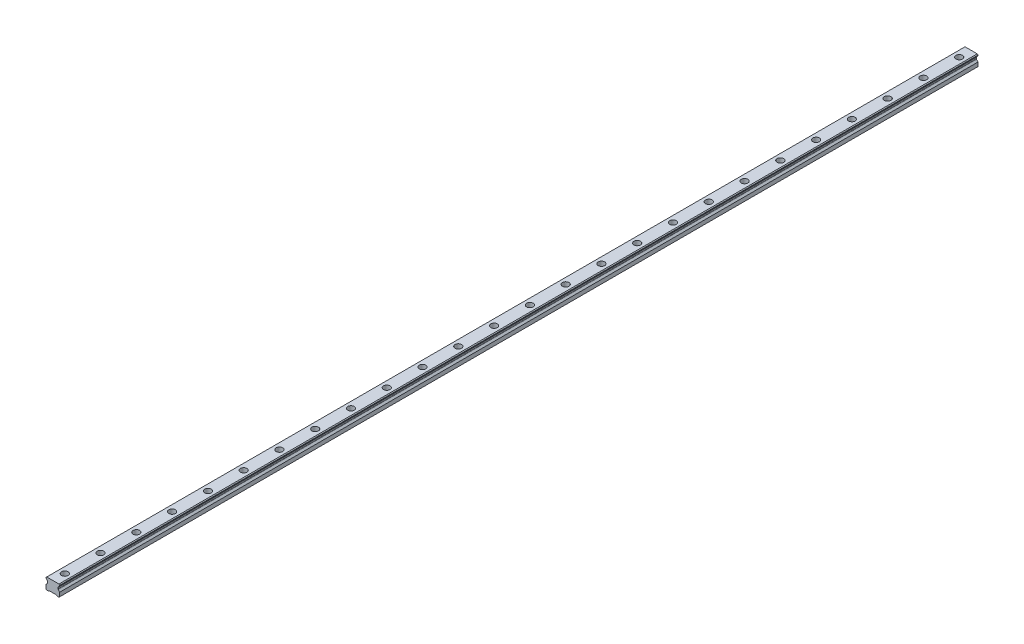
ISO-10303-21;
HEADER;
FILE_DESCRIPTION(('STEP AP214'),'2;1');
FILE_NAME('part.step','',(''),(''),'','','');
FILE_SCHEMA(('AUTOMOTIVE_DESIGN { 1 0 10303 214 1 1 1 1 }'));
ENDSEC;
DATA;
#1=APPLICATION_CONTEXT('core data for automotive mechanical design processes');
#2=APPLICATION_PROTOCOL_DEFINITION('international standard','automotive_design',2000,#1);
#3=PRODUCT_CONTEXT('',#1,'mechanical');
#4=PRODUCT('Part','Part','',(#3));
#5=PRODUCT_RELATED_PRODUCT_CATEGORY('part','',(#4));
#6=PRODUCT_DEFINITION_FORMATION('','',#4);
#7=PRODUCT_DEFINITION_CONTEXT('part definition',#1,'design');
#8=PRODUCT_DEFINITION('design','',#6,#7);
#9=PRODUCT_DEFINITION_SHAPE('','',#8);
#10=(LENGTH_UNIT() NAMED_UNIT(*) SI_UNIT(.MILLI.,.METRE.));
#11=(NAMED_UNIT(*) PLANE_ANGLE_UNIT() SI_UNIT($,.RADIAN.));
#12=(NAMED_UNIT(*) SI_UNIT($,.STERADIAN.) SOLID_ANGLE_UNIT());
#13=UNCERTAINTY_MEASURE_WITH_UNIT(LENGTH_MEASURE(1.E-05),#10,'distance_accuracy_value','');
#14=(GEOMETRIC_REPRESENTATION_CONTEXT(3) GLOBAL_UNCERTAINTY_ASSIGNED_CONTEXT((#13)) GLOBAL_UNIT_ASSIGNED_CONTEXT((#10,
#11,#12)) REPRESENTATION_CONTEXT('',''));
#15=CARTESIAN_POINT('',(0.,0.,0.));
#16=DIRECTION('',(0.,0.,1.));
#17=DIRECTION('',(1.,0.,0.));
#18=AXIS2_PLACEMENT_3D('',#15,#16,#17);
#19=CARTESIAN_POINT('',(0.,10.2,-750.));
#20=DIRECTION('',(0.,1.,0.));
#21=DIRECTION('',(0.,0.,1.));
#22=AXIS2_PLACEMENT_3D('',#19,#20,#21);
#23=PLANE('',#22);
#24=CARTESIAN_POINT('',(0.,10.2,-750.));
#25=DIRECTION('',(0.,1.,0.));
#26=DIRECTION('',(0.,0.,1.));
#27=AXIS2_PLACEMENT_3D('',#24,#25,#26);
#28=CIRCLE('',#27,3.5);
#29=CARTESIAN_POINT('',(0.,10.2,-746.5));
#30=VERTEX_POINT('',#29);
#31=EDGE_CURVE('E550',#30,#30,#28,.T.);
#32=ORIENTED_EDGE('',*,*,#31,.F.);
#33=EDGE_LOOP('',(#32));
#34=FACE_BOUND('',#33,.T.);
#35=CARTESIAN_POINT('',(0.,10.2,-750.));
#36=DIRECTION('',(0.,1.,0.));
#37=DIRECTION('',(0.,0.,1.));
#38=AXIS2_PLACEMENT_3D('',#35,#36,#37);
#39=CIRCLE('',#38,5.5);
#40=CARTESIAN_POINT('',(0.,10.2,-744.5));
#41=VERTEX_POINT('',#40);
#42=EDGE_CURVE('E11',#41,#41,#39,.T.);
#43=ORIENTED_EDGE('',*,*,#42,.T.);
#44=EDGE_LOOP('',(#43));
#45=FACE_BOUND('',#44,.T.);
#46=ADVANCED_FACE('F39',(#34,#45),#23,.T.);
#47=CARTESIAN_POINT('',(0.,10.2,-750.));
#48=DIRECTION('',(0.,1.,0.));
#49=DIRECTION('',(0.,0.,1.));
#50=AXIS2_PLACEMENT_3D('',#47,#48,#49);
#51=CYLINDRICAL_SURFACE('',#50,5.5);
#52=ORIENTED_EDGE('',*,*,#42,.F.);
#53=EDGE_LOOP('',(#52));
#54=FACE_BOUND('',#53,.T.);
#55=CARTESIAN_POINT('',(0.,19.2,-750.));
#56=DIRECTION('',(0.,1.,0.));
#57=DIRECTION('',(0.,0.,1.));
#58=AXIS2_PLACEMENT_3D('',#55,#56,#57);
#59=CIRCLE('',#58,5.5);
#60=CARTESIAN_POINT('',(0.,19.2,-744.5));
#61=VERTEX_POINT('',#60);
#62=EDGE_CURVE('E48',#61,#61,#59,.T.);
#63=ORIENTED_EDGE('',*,*,#62,.T.);
#64=EDGE_LOOP('',(#63));
#65=FACE_BOUND('',#64,.T.);
#66=ADVANCED_FACE('F919',(#54,#65),#51,.F.);
#67=CARTESIAN_POINT('',(0.,10.2,-690.));
#68=DIRECTION('',(0.,1.,0.));
#69=DIRECTION('',(0.,0.,1.));
#70=AXIS2_PLACEMENT_3D('',#67,#68,#69);
#71=PLANE('',#70);
#72=CARTESIAN_POINT('',(0.,10.2,-690.));
#73=DIRECTION('',(0.,1.,0.));
#74=DIRECTION('',(0.,0.,1.));
#75=AXIS2_PLACEMENT_3D('',#72,#73,#74);
#76=CIRCLE('',#75,3.5);
#77=CARTESIAN_POINT('',(0.,10.2,-686.5));
#78=VERTEX_POINT('',#77);
#79=EDGE_CURVE('E555',#78,#78,#76,.T.);
#80=ORIENTED_EDGE('',*,*,#79,.F.);
#81=EDGE_LOOP('',(#80));
#82=FACE_BOUND('',#81,.T.);
#83=CARTESIAN_POINT('',(0.,10.2,-690.));
#84=DIRECTION('',(0.,1.,0.));
#85=DIRECTION('',(0.,0.,1.));
#86=AXIS2_PLACEMENT_3D('',#83,#84,#85);
#87=CIRCLE('',#86,5.5);
#88=CARTESIAN_POINT('',(0.,10.2,-684.5));
#89=VERTEX_POINT('',#88);
#90=EDGE_CURVE('E534',#89,#89,#87,.T.);
#91=ORIENTED_EDGE('',*,*,#90,.T.);
#92=EDGE_LOOP('',(#91));
#93=FACE_BOUND('',#92,.T.);
#94=ADVANCED_FACE('F921',(#82,#93),#71,.T.);
#95=CARTESIAN_POINT('',(0.,10.2,-690.));
#96=DIRECTION('',(0.,1.,0.));
#97=DIRECTION('',(0.,0.,1.));
#98=AXIS2_PLACEMENT_3D('',#95,#96,#97);
#99=CYLINDRICAL_SURFACE('',#98,5.5);
#100=ORIENTED_EDGE('',*,*,#90,.F.);
#101=EDGE_LOOP('',(#100));
#102=FACE_BOUND('',#101,.T.);
#103=CARTESIAN_POINT('',(0.,19.2,-690.));
#104=DIRECTION('',(0.,1.,0.));
#105=DIRECTION('',(0.,0.,1.));
#106=AXIS2_PLACEMENT_3D('',#103,#104,#105);
#107=CIRCLE('',#106,5.5);
#108=CARTESIAN_POINT('',(0.,19.2,-684.5));
#109=VERTEX_POINT('',#108);
#110=EDGE_CURVE('E530',#109,#109,#107,.T.);
#111=ORIENTED_EDGE('',*,*,#110,.T.);
#112=EDGE_LOOP('',(#111));
#113=FACE_BOUND('',#112,.T.);
#114=ADVANCED_FACE('F927',(#102,#113),#99,.F.);
#115=CARTESIAN_POINT('',(0.,10.2,-630.));
#116=DIRECTION('',(0.,1.,0.));
#117=DIRECTION('',(0.,0.,1.));
#118=AXIS2_PLACEMENT_3D('',#115,#116,#117);
#119=PLANE('',#118);
#120=CARTESIAN_POINT('',(0.,10.2,-630.));
#121=DIRECTION('',(0.,1.,0.));
#122=DIRECTION('',(0.,0.,1.));
#123=AXIS2_PLACEMENT_3D('',#120,#121,#122);
#124=CIRCLE('',#123,3.5);
#125=CARTESIAN_POINT('',(0.,10.2,-626.5));
#126=VERTEX_POINT('',#125);
#127=EDGE_CURVE('E560',#126,#126,#124,.T.);
#128=ORIENTED_EDGE('',*,*,#127,.F.);
#129=EDGE_LOOP('',(#128));
#130=FACE_BOUND('',#129,.T.);
#131=CARTESIAN_POINT('',(0.,10.2,-630.));
#132=DIRECTION('',(0.,1.,0.));
#133=DIRECTION('',(0.,0.,1.));
#134=AXIS2_PLACEMENT_3D('',#131,#132,#133);
#135=CIRCLE('',#134,5.5);
#136=CARTESIAN_POINT('',(0.,10.2,-624.5));
#137=VERTEX_POINT('',#136);
#138=EDGE_CURVE('E526',#137,#137,#135,.T.);
#139=ORIENTED_EDGE('',*,*,#138,.T.);
#140=EDGE_LOOP('',(#139));
#141=FACE_BOUND('',#140,.T.);
#142=ADVANCED_FACE('F935',(#130,#141),#119,.T.);
#143=CARTESIAN_POINT('',(0.,10.2,-630.));
#144=DIRECTION('',(0.,1.,0.));
#145=DIRECTION('',(0.,0.,1.));
#146=AXIS2_PLACEMENT_3D('',#143,#144,#145);
#147=CYLINDRICAL_SURFACE('',#146,5.5);
#148=ORIENTED_EDGE('',*,*,#138,.F.);
#149=EDGE_LOOP('',(#148));
#150=FACE_BOUND('',#149,.T.);
#151=CARTESIAN_POINT('',(0.,19.2,-630.));
#152=DIRECTION('',(0.,1.,0.));
#153=DIRECTION('',(0.,0.,1.));
#154=AXIS2_PLACEMENT_3D('',#151,#152,#153);
#155=CIRCLE('',#154,5.5);
#156=CARTESIAN_POINT('',(0.,19.2,-624.5));
#157=VERTEX_POINT('',#156);
#158=EDGE_CURVE('E522',#157,#157,#155,.T.);
#159=ORIENTED_EDGE('',*,*,#158,.T.);
#160=EDGE_LOOP('',(#159));
#161=FACE_BOUND('',#160,.T.);
#162=ADVANCED_FACE('F939',(#150,#161),#147,.F.);
#163=CARTESIAN_POINT('',(0.,10.2,-570.));
#164=DIRECTION('',(0.,1.,0.));
#165=DIRECTION('',(0.,0.,1.));
#166=AXIS2_PLACEMENT_3D('',#163,#164,#165);
#167=PLANE('',#166);
#168=CARTESIAN_POINT('',(0.,10.2,-570.));
#169=DIRECTION('',(0.,1.,0.));
#170=DIRECTION('',(0.,0.,1.));
#171=AXIS2_PLACEMENT_3D('',#168,#169,#170);
#172=CIRCLE('',#171,3.5);
#173=CARTESIAN_POINT('',(0.,10.2,-566.5));
#174=VERTEX_POINT('',#173);
#175=EDGE_CURVE('E565',#174,#174,#172,.T.);
#176=ORIENTED_EDGE('',*,*,#175,.F.);
#177=EDGE_LOOP('',(#176));
#178=FACE_BOUND('',#177,.T.);
#179=CARTESIAN_POINT('',(0.,10.2,-570.));
#180=DIRECTION('',(0.,1.,0.));
#181=DIRECTION('',(0.,0.,1.));
#182=AXIS2_PLACEMENT_3D('',#179,#180,#181);
#183=CIRCLE('',#182,5.5);
#184=CARTESIAN_POINT('',(0.,10.2,-564.5));
#185=VERTEX_POINT('',#184);
#186=EDGE_CURVE('E518',#185,#185,#183,.T.);
#187=ORIENTED_EDGE('',*,*,#186,.T.);
#188=EDGE_LOOP('',(#187));
#189=FACE_BOUND('',#188,.T.);
#190=ADVANCED_FACE('F943',(#178,#189),#167,.T.);
#191=CARTESIAN_POINT('',(0.,10.2,-570.));
#192=DIRECTION('',(0.,1.,0.));
#193=DIRECTION('',(0.,0.,1.));
#194=AXIS2_PLACEMENT_3D('',#191,#192,#193);
#195=CYLINDRICAL_SURFACE('',#194,5.5);
#196=ORIENTED_EDGE('',*,*,#186,.F.);
#197=EDGE_LOOP('',(#196));
#198=FACE_BOUND('',#197,.T.);
#199=CARTESIAN_POINT('',(0.,19.2,-570.));
#200=DIRECTION('',(0.,1.,0.));
#201=DIRECTION('',(0.,0.,1.));
#202=AXIS2_PLACEMENT_3D('',#199,#200,#201);
#203=CIRCLE('',#202,5.5);
#204=CARTESIAN_POINT('',(0.,19.2,-564.5));
#205=VERTEX_POINT('',#204);
#206=EDGE_CURVE('E514',#205,#205,#203,.T.);
#207=ORIENTED_EDGE('',*,*,#206,.T.);
#208=EDGE_LOOP('',(#207));
#209=FACE_BOUND('',#208,.T.);
#210=ADVANCED_FACE('F947',(#198,#209),#195,.F.);
#211=CARTESIAN_POINT('',(0.,10.2,-510.));
#212=DIRECTION('',(0.,1.,0.));
#213=DIRECTION('',(0.,0.,1.));
#214=AXIS2_PLACEMENT_3D('',#211,#212,#213);
#215=PLANE('',#214);
#216=CARTESIAN_POINT('',(0.,10.2,-510.));
#217=DIRECTION('',(0.,1.,0.));
#218=DIRECTION('',(0.,0.,1.));
#219=AXIS2_PLACEMENT_3D('',#216,#217,#218);
#220=CIRCLE('',#219,3.5);
#221=CARTESIAN_POINT('',(0.,10.2,-506.5));
#222=VERTEX_POINT('',#221);
#223=EDGE_CURVE('E570',#222,#222,#220,.T.);
#224=ORIENTED_EDGE('',*,*,#223,.F.);
#225=EDGE_LOOP('',(#224));
#226=FACE_BOUND('',#225,.T.);
#227=CARTESIAN_POINT('',(0.,10.2,-510.));
#228=DIRECTION('',(0.,1.,0.));
#229=DIRECTION('',(0.,0.,1.));
#230=AXIS2_PLACEMENT_3D('',#227,#228,#229);
#231=CIRCLE('',#230,5.5);
#232=CARTESIAN_POINT('',(0.,10.2,-504.5));
#233=VERTEX_POINT('',#232);
#234=EDGE_CURVE('E510',#233,#233,#231,.T.);
#235=ORIENTED_EDGE('',*,*,#234,.T.);
#236=EDGE_LOOP('',(#235));
#237=FACE_BOUND('',#236,.T.);
#238=ADVANCED_FACE('F951',(#226,#237),#215,.T.);
#239=CARTESIAN_POINT('',(0.,10.2,-510.));
#240=DIRECTION('',(0.,1.,0.));
#241=DIRECTION('',(0.,0.,1.));
#242=AXIS2_PLACEMENT_3D('',#239,#240,#241);
#243=CYLINDRICAL_SURFACE('',#242,5.5);
#244=ORIENTED_EDGE('',*,*,#234,.F.);
#245=EDGE_LOOP('',(#244));
#246=FACE_BOUND('',#245,.T.);
#247=CARTESIAN_POINT('',(0.,19.2,-510.));
#248=DIRECTION('',(0.,1.,0.));
#249=DIRECTION('',(0.,0.,1.));
#250=AXIS2_PLACEMENT_3D('',#247,#248,#249);
#251=CIRCLE('',#250,5.5);
#252=CARTESIAN_POINT('',(0.,19.2,-504.5));
#253=VERTEX_POINT('',#252);
#254=EDGE_CURVE('E506',#253,#253,#251,.T.);
#255=ORIENTED_EDGE('',*,*,#254,.T.);
#256=EDGE_LOOP('',(#255));
#257=FACE_BOUND('',#256,.T.);
#258=ADVANCED_FACE('F955',(#246,#257),#243,.F.);
#259=CARTESIAN_POINT('',(0.,10.2,-450.));
#260=DIRECTION('',(0.,1.,0.));
#261=DIRECTION('',(0.,0.,1.));
#262=AXIS2_PLACEMENT_3D('',#259,#260,#261);
#263=PLANE('',#262);
#264=CARTESIAN_POINT('',(0.,10.2,-450.));
#265=DIRECTION('',(0.,1.,0.));
#266=DIRECTION('',(0.,0.,1.));
#267=AXIS2_PLACEMENT_3D('',#264,#265,#266);
#268=CIRCLE('',#267,3.5);
#269=CARTESIAN_POINT('',(0.,10.2,-446.5));
#270=VERTEX_POINT('',#269);
#271=EDGE_CURVE('E575',#270,#270,#268,.T.);
#272=ORIENTED_EDGE('',*,*,#271,.F.);
#273=EDGE_LOOP('',(#272));
#274=FACE_BOUND('',#273,.T.);
#275=CARTESIAN_POINT('',(0.,10.2,-450.));
#276=DIRECTION('',(0.,1.,0.));
#277=DIRECTION('',(0.,0.,1.));
#278=AXIS2_PLACEMENT_3D('',#275,#276,#277);
#279=CIRCLE('',#278,5.5);
#280=CARTESIAN_POINT('',(0.,10.2,-444.5));
#281=VERTEX_POINT('',#280);
#282=EDGE_CURVE('E502',#281,#281,#279,.T.);
#283=ORIENTED_EDGE('',*,*,#282,.T.);
#284=EDGE_LOOP('',(#283));
#285=FACE_BOUND('',#284,.T.);
#286=ADVANCED_FACE('F959',(#274,#285),#263,.T.);
#287=CARTESIAN_POINT('',(0.,10.2,-450.));
#288=DIRECTION('',(0.,1.,0.));
#289=DIRECTION('',(0.,0.,1.));
#290=AXIS2_PLACEMENT_3D('',#287,#288,#289);
#291=CYLINDRICAL_SURFACE('',#290,5.5);
#292=ORIENTED_EDGE('',*,*,#282,.F.);
#293=EDGE_LOOP('',(#292));
#294=FACE_BOUND('',#293,.T.);
#295=CARTESIAN_POINT('',(0.,19.2,-450.));
#296=DIRECTION('',(0.,1.,0.));
#297=DIRECTION('',(0.,0.,1.));
#298=AXIS2_PLACEMENT_3D('',#295,#296,#297);
#299=CIRCLE('',#298,5.5);
#300=CARTESIAN_POINT('',(0.,19.2,-444.5));
#301=VERTEX_POINT('',#300);
#302=EDGE_CURVE('E498',#301,#301,#299,.T.);
#303=ORIENTED_EDGE('',*,*,#302,.T.);
#304=EDGE_LOOP('',(#303));
#305=FACE_BOUND('',#304,.T.);
#306=ADVANCED_FACE('F963',(#294,#305),#291,.F.);
#307=CARTESIAN_POINT('',(0.,10.2,-390.));
#308=DIRECTION('',(0.,1.,0.));
#309=DIRECTION('',(0.,0.,1.));
#310=AXIS2_PLACEMENT_3D('',#307,#308,#309);
#311=PLANE('',#310);
#312=CARTESIAN_POINT('',(0.,10.2,-390.));
#313=DIRECTION('',(0.,1.,0.));
#314=DIRECTION('',(0.,0.,1.));
#315=AXIS2_PLACEMENT_3D('',#312,#313,#314);
#316=CIRCLE('',#315,3.5);
#317=CARTESIAN_POINT('',(0.,10.2,-386.5));
#318=VERTEX_POINT('',#317);
#319=EDGE_CURVE('E580',#318,#318,#316,.T.);
#320=ORIENTED_EDGE('',*,*,#319,.F.);
#321=EDGE_LOOP('',(#320));
#322=FACE_BOUND('',#321,.T.);
#323=CARTESIAN_POINT('',(0.,10.2,-390.));
#324=DIRECTION('',(0.,1.,0.));
#325=DIRECTION('',(0.,0.,1.));
#326=AXIS2_PLACEMENT_3D('',#323,#324,#325);
#327=CIRCLE('',#326,5.5);
#328=CARTESIAN_POINT('',(0.,10.2,-384.5));
#329=VERTEX_POINT('',#328);
#330=EDGE_CURVE('E494',#329,#329,#327,.T.);
#331=ORIENTED_EDGE('',*,*,#330,.T.);
#332=EDGE_LOOP('',(#331));
#333=FACE_BOUND('',#332,.T.);
#334=ADVANCED_FACE('F967',(#322,#333),#311,.T.);
#335=CARTESIAN_POINT('',(0.,10.2,-390.));
#336=DIRECTION('',(0.,1.,0.));
#337=DIRECTION('',(0.,0.,1.));
#338=AXIS2_PLACEMENT_3D('',#335,#336,#337);
#339=CYLINDRICAL_SURFACE('',#338,5.5);
#340=ORIENTED_EDGE('',*,*,#330,.F.);
#341=EDGE_LOOP('',(#340));
#342=FACE_BOUND('',#341,.T.);
#343=CARTESIAN_POINT('',(0.,19.2,-390.));
#344=DIRECTION('',(0.,1.,0.));
#345=DIRECTION('',(0.,0.,1.));
#346=AXIS2_PLACEMENT_3D('',#343,#344,#345);
#347=CIRCLE('',#346,5.5);
#348=CARTESIAN_POINT('',(0.,19.2,-384.5));
#349=VERTEX_POINT('',#348);
#350=EDGE_CURVE('E490',#349,#349,#347,.T.);
#351=ORIENTED_EDGE('',*,*,#350,.T.);
#352=EDGE_LOOP('',(#351));
#353=FACE_BOUND('',#352,.T.);
#354=ADVANCED_FACE('F971',(#342,#353),#339,.F.);
#355=CARTESIAN_POINT('',(0.,10.2,-330.));
#356=DIRECTION('',(0.,1.,0.));
#357=DIRECTION('',(0.,0.,1.));
#358=AXIS2_PLACEMENT_3D('',#355,#356,#357);
#359=PLANE('',#358);
#360=CARTESIAN_POINT('',(0.,10.2,-330.));
#361=DIRECTION('',(0.,1.,0.));
#362=DIRECTION('',(0.,0.,1.));
#363=AXIS2_PLACEMENT_3D('',#360,#361,#362);
#364=CIRCLE('',#363,3.5);
#365=CARTESIAN_POINT('',(0.,10.2,-326.5));
#366=VERTEX_POINT('',#365);
#367=EDGE_CURVE('E585',#366,#366,#364,.T.);
#368=ORIENTED_EDGE('',*,*,#367,.F.);
#369=EDGE_LOOP('',(#368));
#370=FACE_BOUND('',#369,.T.);
#371=CARTESIAN_POINT('',(0.,10.2,-330.));
#372=DIRECTION('',(0.,1.,0.));
#373=DIRECTION('',(0.,0.,1.));
#374=AXIS2_PLACEMENT_3D('',#371,#372,#373);
#375=CIRCLE('',#374,5.5);
#376=CARTESIAN_POINT('',(0.,10.2,-324.5));
#377=VERTEX_POINT('',#376);
#378=EDGE_CURVE('E486',#377,#377,#375,.T.);
#379=ORIENTED_EDGE('',*,*,#378,.T.);
#380=EDGE_LOOP('',(#379));
#381=FACE_BOUND('',#380,.T.);
#382=ADVANCED_FACE('F975',(#370,#381),#359,.T.);
#383=CARTESIAN_POINT('',(0.,10.2,-330.));
#384=DIRECTION('',(0.,1.,0.));
#385=DIRECTION('',(0.,0.,1.));
#386=AXIS2_PLACEMENT_3D('',#383,#384,#385);
#387=CYLINDRICAL_SURFACE('',#386,5.5);
#388=ORIENTED_EDGE('',*,*,#378,.F.);
#389=EDGE_LOOP('',(#388));
#390=FACE_BOUND('',#389,.T.);
#391=CARTESIAN_POINT('',(0.,19.2,-330.));
#392=DIRECTION('',(0.,1.,0.));
#393=DIRECTION('',(0.,0.,1.));
#394=AXIS2_PLACEMENT_3D('',#391,#392,#393);
#395=CIRCLE('',#394,5.5);
#396=CARTESIAN_POINT('',(0.,19.2,-324.5));
#397=VERTEX_POINT('',#396);
#398=EDGE_CURVE('E482',#397,#397,#395,.T.);
#399=ORIENTED_EDGE('',*,*,#398,.T.);
#400=EDGE_LOOP('',(#399));
#401=FACE_BOUND('',#400,.T.);
#402=ADVANCED_FACE('F979',(#390,#401),#387,.F.);
#403=CARTESIAN_POINT('',(0.,10.2,-270.));
#404=DIRECTION('',(0.,1.,0.));
#405=DIRECTION('',(0.,0.,1.));
#406=AXIS2_PLACEMENT_3D('',#403,#404,#405);
#407=PLANE('',#406);
#408=CARTESIAN_POINT('',(0.,10.2,-270.));
#409=DIRECTION('',(0.,1.,0.));
#410=DIRECTION('',(0.,0.,1.));
#411=AXIS2_PLACEMENT_3D('',#408,#409,#410);
#412=CIRCLE('',#411,3.5);
#413=CARTESIAN_POINT('',(0.,10.2,-266.5));
#414=VERTEX_POINT('',#413);
#415=EDGE_CURVE('E590',#414,#414,#412,.T.);
#416=ORIENTED_EDGE('',*,*,#415,.F.);
#417=EDGE_LOOP('',(#416));
#418=FACE_BOUND('',#417,.T.);
#419=CARTESIAN_POINT('',(0.,10.2,-270.));
#420=DIRECTION('',(0.,1.,0.));
#421=DIRECTION('',(0.,0.,1.));
#422=AXIS2_PLACEMENT_3D('',#419,#420,#421);
#423=CIRCLE('',#422,5.5);
#424=CARTESIAN_POINT('',(0.,10.2,-264.5));
#425=VERTEX_POINT('',#424);
#426=EDGE_CURVE('E478',#425,#425,#423,.T.);
#427=ORIENTED_EDGE('',*,*,#426,.T.);
#428=EDGE_LOOP('',(#427));
#429=FACE_BOUND('',#428,.T.);
#430=ADVANCED_FACE('F983',(#418,#429),#407,.T.);
#431=CARTESIAN_POINT('',(0.,10.2,-270.));
#432=DIRECTION('',(0.,1.,0.));
#433=DIRECTION('',(0.,0.,1.));
#434=AXIS2_PLACEMENT_3D('',#431,#432,#433);
#435=CYLINDRICAL_SURFACE('',#434,5.5);
#436=ORIENTED_EDGE('',*,*,#426,.F.);
#437=EDGE_LOOP('',(#436));
#438=FACE_BOUND('',#437,.T.);
#439=CARTESIAN_POINT('',(0.,19.2,-270.));
#440=DIRECTION('',(0.,1.,0.));
#441=DIRECTION('',(0.,0.,1.));
#442=AXIS2_PLACEMENT_3D('',#439,#440,#441);
#443=CIRCLE('',#442,5.5);
#444=CARTESIAN_POINT('',(0.,19.2,-264.5));
#445=VERTEX_POINT('',#444);
#446=EDGE_CURVE('E474',#445,#445,#443,.T.);
#447=ORIENTED_EDGE('',*,*,#446,.T.);
#448=EDGE_LOOP('',(#447));
#449=FACE_BOUND('',#448,.T.);
#450=ADVANCED_FACE('F987',(#438,#449),#435,.F.);
#451=CARTESIAN_POINT('',(0.,10.2,-210.));
#452=DIRECTION('',(0.,1.,0.));
#453=DIRECTION('',(0.,0.,1.));
#454=AXIS2_PLACEMENT_3D('',#451,#452,#453);
#455=PLANE('',#454);
#456=CARTESIAN_POINT('',(0.,10.2,-210.));
#457=DIRECTION('',(0.,1.,0.));
#458=DIRECTION('',(0.,0.,1.));
#459=AXIS2_PLACEMENT_3D('',#456,#457,#458);
#460=CIRCLE('',#459,3.5);
#461=CARTESIAN_POINT('',(0.,10.2,-206.5));
#462=VERTEX_POINT('',#461);
#463=EDGE_CURVE('E595',#462,#462,#460,.T.);
#464=ORIENTED_EDGE('',*,*,#463,.F.);
#465=EDGE_LOOP('',(#464));
#466=FACE_BOUND('',#465,.T.);
#467=CARTESIAN_POINT('',(0.,10.2,-210.));
#468=DIRECTION('',(0.,1.,0.));
#469=DIRECTION('',(0.,0.,1.));
#470=AXIS2_PLACEMENT_3D('',#467,#468,#469);
#471=CIRCLE('',#470,5.5);
#472=CARTESIAN_POINT('',(0.,10.2,-204.5));
#473=VERTEX_POINT('',#472);
#474=EDGE_CURVE('E470',#473,#473,#471,.T.);
#475=ORIENTED_EDGE('',*,*,#474,.T.);
#476=EDGE_LOOP('',(#475));
#477=FACE_BOUND('',#476,.T.);
#478=ADVANCED_FACE('F991',(#466,#477),#455,.T.);
#479=CARTESIAN_POINT('',(0.,10.2,-210.));
#480=DIRECTION('',(0.,1.,0.));
#481=DIRECTION('',(0.,0.,1.));
#482=AXIS2_PLACEMENT_3D('',#479,#480,#481);
#483=CYLINDRICAL_SURFACE('',#482,5.5);
#484=ORIENTED_EDGE('',*,*,#474,.F.);
#485=EDGE_LOOP('',(#484));
#486=FACE_BOUND('',#485,.T.);
#487=CARTESIAN_POINT('',(0.,19.2,-210.));
#488=DIRECTION('',(0.,1.,0.));
#489=DIRECTION('',(0.,0.,1.));
#490=AXIS2_PLACEMENT_3D('',#487,#488,#489);
#491=CIRCLE('',#490,5.5);
#492=CARTESIAN_POINT('',(0.,19.2,-204.5));
#493=VERTEX_POINT('',#492);
#494=EDGE_CURVE('E466',#493,#493,#491,.T.);
#495=ORIENTED_EDGE('',*,*,#494,.T.);
#496=EDGE_LOOP('',(#495));
#497=FACE_BOUND('',#496,.T.);
#498=ADVANCED_FACE('F995',(#486,#497),#483,.F.);
#499=CARTESIAN_POINT('',(0.,10.2,-150.));
#500=DIRECTION('',(0.,1.,0.));
#501=DIRECTION('',(0.,0.,1.));
#502=AXIS2_PLACEMENT_3D('',#499,#500,#501);
#503=PLANE('',#502);
#504=CARTESIAN_POINT('',(0.,10.2,-150.));
#505=DIRECTION('',(0.,1.,0.));
#506=DIRECTION('',(0.,0.,1.));
#507=AXIS2_PLACEMENT_3D('',#504,#505,#506);
#508=CIRCLE('',#507,3.5);
#509=CARTESIAN_POINT('',(0.,10.2,-146.5));
#510=VERTEX_POINT('',#509);
#511=EDGE_CURVE('E600',#510,#510,#508,.T.);
#512=ORIENTED_EDGE('',*,*,#511,.F.);
#513=EDGE_LOOP('',(#512));
#514=FACE_BOUND('',#513,.T.);
#515=CARTESIAN_POINT('',(0.,10.2,-150.));
#516=DIRECTION('',(0.,1.,0.));
#517=DIRECTION('',(0.,0.,1.));
#518=AXIS2_PLACEMENT_3D('',#515,#516,#517);
#519=CIRCLE('',#518,5.5);
#520=CARTESIAN_POINT('',(0.,10.2,-144.5));
#521=VERTEX_POINT('',#520);
#522=EDGE_CURVE('E462',#521,#521,#519,.T.);
#523=ORIENTED_EDGE('',*,*,#522,.T.);
#524=EDGE_LOOP('',(#523));
#525=FACE_BOUND('',#524,.T.);
#526=ADVANCED_FACE('F999',(#514,#525),#503,.T.);
#527=CARTESIAN_POINT('',(0.,10.2,-150.));
#528=DIRECTION('',(0.,1.,0.));
#529=DIRECTION('',(0.,0.,1.));
#530=AXIS2_PLACEMENT_3D('',#527,#528,#529);
#531=CYLINDRICAL_SURFACE('',#530,5.5);
#532=ORIENTED_EDGE('',*,*,#522,.F.);
#533=EDGE_LOOP('',(#532));
#534=FACE_BOUND('',#533,.T.);
#535=CARTESIAN_POINT('',(0.,19.2,-150.));
#536=DIRECTION('',(0.,1.,0.));
#537=DIRECTION('',(0.,0.,1.));
#538=AXIS2_PLACEMENT_3D('',#535,#536,#537);
#539=CIRCLE('',#538,5.5);
#540=CARTESIAN_POINT('',(0.,19.2,-144.5));
#541=VERTEX_POINT('',#540);
#542=EDGE_CURVE('E458',#541,#541,#539,.T.);
#543=ORIENTED_EDGE('',*,*,#542,.T.);
#544=EDGE_LOOP('',(#543));
#545=FACE_BOUND('',#544,.T.);
#546=ADVANCED_FACE('F1003',(#534,#545),#531,.F.);
#547=CARTESIAN_POINT('',(0.,10.2,-90.0000000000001));
#548=DIRECTION('',(0.,1.,0.));
#549=DIRECTION('',(0.,0.,1.));
#550=AXIS2_PLACEMENT_3D('',#547,#548,#549);
#551=PLANE('',#550);
#552=CARTESIAN_POINT('',(0.,10.2,-90.));
#553=DIRECTION('',(0.,1.,0.));
#554=DIRECTION('',(0.,0.,1.));
#555=AXIS2_PLACEMENT_3D('',#552,#553,#554);
#556=CIRCLE('',#555,3.5);
#557=CARTESIAN_POINT('',(0.,10.2,-86.5));
#558=VERTEX_POINT('',#557);
#559=EDGE_CURVE('E605',#558,#558,#556,.T.);
#560=ORIENTED_EDGE('',*,*,#559,.F.);
#561=EDGE_LOOP('',(#560));
#562=FACE_BOUND('',#561,.T.);
#563=CARTESIAN_POINT('',(0.,10.2,-90.0000000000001));
#564=DIRECTION('',(0.,1.,0.));
#565=DIRECTION('',(0.,0.,1.));
#566=AXIS2_PLACEMENT_3D('',#563,#564,#565);
#567=CIRCLE('',#566,5.5);
#568=CARTESIAN_POINT('',(0.,10.2,-84.5000000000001));
#569=VERTEX_POINT('',#568);
#570=EDGE_CURVE('E454',#569,#569,#567,.T.);
#571=ORIENTED_EDGE('',*,*,#570,.T.);
#572=EDGE_LOOP('',(#571));
#573=FACE_BOUND('',#572,.T.);
#574=ADVANCED_FACE('F1007',(#562,#573),#551,.T.);
#575=CARTESIAN_POINT('',(0.,10.2,-90.0000000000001));
#576=DIRECTION('',(0.,1.,0.));
#577=DIRECTION('',(0.,0.,1.));
#578=AXIS2_PLACEMENT_3D('',#575,#576,#577);
#579=CYLINDRICAL_SURFACE('',#578,5.5);
#580=ORIENTED_EDGE('',*,*,#570,.F.);
#581=EDGE_LOOP('',(#580));
#582=FACE_BOUND('',#581,.T.);
#583=CARTESIAN_POINT('',(0.,19.2,-90.0000000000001));
#584=DIRECTION('',(0.,1.,0.));
#585=DIRECTION('',(0.,0.,1.));
#586=AXIS2_PLACEMENT_3D('',#583,#584,#585);
#587=CIRCLE('',#586,5.5);
#588=CARTESIAN_POINT('',(0.,19.2,-84.5000000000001));
#589=VERTEX_POINT('',#588);
#590=EDGE_CURVE('E450',#589,#589,#587,.T.);
#591=ORIENTED_EDGE('',*,*,#590,.T.);
#592=EDGE_LOOP('',(#591));
#593=FACE_BOUND('',#592,.T.);
#594=ADVANCED_FACE('F1011',(#582,#593),#579,.F.);
#595=CARTESIAN_POINT('',(0.,10.2,-30.));
#596=DIRECTION('',(0.,1.,0.));
#597=DIRECTION('',(0.,0.,1.));
#598=AXIS2_PLACEMENT_3D('',#595,#596,#597);
#599=PLANE('',#598);
#600=CARTESIAN_POINT('',(0.,10.2,-30.));
#601=DIRECTION('',(0.,1.,0.));
#602=DIRECTION('',(0.,0.,1.));
#603=AXIS2_PLACEMENT_3D('',#600,#601,#602);
#604=CIRCLE('',#603,3.5);
#605=CARTESIAN_POINT('',(0.,10.2,-26.5));
#606=VERTEX_POINT('',#605);
#607=EDGE_CURVE('E610',#606,#606,#604,.T.);
#608=ORIENTED_EDGE('',*,*,#607,.F.);
#609=EDGE_LOOP('',(#608));
#610=FACE_BOUND('',#609,.T.);
#611=CARTESIAN_POINT('',(0.,10.2,-30.));
#612=DIRECTION('',(0.,1.,0.));
#613=DIRECTION('',(0.,0.,1.));
#614=AXIS2_PLACEMENT_3D('',#611,#612,#613);
#615=CIRCLE('',#614,5.5);
#616=CARTESIAN_POINT('',(0.,10.2,-24.5));
#617=VERTEX_POINT('',#616);
#618=EDGE_CURVE('E446',#617,#617,#615,.T.);
#619=ORIENTED_EDGE('',*,*,#618,.T.);
#620=EDGE_LOOP('',(#619));
#621=FACE_BOUND('',#620,.T.);
#622=ADVANCED_FACE('F1015',(#610,#621),#599,.T.);
#623=CARTESIAN_POINT('',(0.,10.2,-30.));
#624=DIRECTION('',(0.,1.,0.));
#625=DIRECTION('',(0.,0.,1.));
#626=AXIS2_PLACEMENT_3D('',#623,#624,#625);
#627=CYLINDRICAL_SURFACE('',#626,5.5);
#628=ORIENTED_EDGE('',*,*,#618,.F.);
#629=EDGE_LOOP('',(#628));
#630=FACE_BOUND('',#629,.T.);
#631=CARTESIAN_POINT('',(0.,19.2,-30.));
#632=DIRECTION('',(0.,1.,0.));
#633=DIRECTION('',(0.,0.,1.));
#634=AXIS2_PLACEMENT_3D('',#631,#632,#633);
#635=CIRCLE('',#634,5.5);
#636=CARTESIAN_POINT('',(0.,19.2,-24.5));
#637=VERTEX_POINT('',#636);
#638=EDGE_CURVE('E442',#637,#637,#635,.T.);
#639=ORIENTED_EDGE('',*,*,#638,.T.);
#640=EDGE_LOOP('',(#639));
#641=FACE_BOUND('',#640,.T.);
#642=ADVANCED_FACE('F1019',(#630,#641),#627,.F.);
#643=CARTESIAN_POINT('',(0.,10.2,30.));
#644=DIRECTION('',(0.,1.,0.));
#645=DIRECTION('',(0.,0.,1.));
#646=AXIS2_PLACEMENT_3D('',#643,#644,#645);
#647=PLANE('',#646);
#648=CARTESIAN_POINT('',(0.,10.2,30.));
#649=DIRECTION('',(0.,1.,0.));
#650=DIRECTION('',(0.,0.,1.));
#651=AXIS2_PLACEMENT_3D('',#648,#649,#650);
#652=CIRCLE('',#651,3.5);
#653=CARTESIAN_POINT('',(0.,10.2,33.5));
#654=VERTEX_POINT('',#653);
#655=EDGE_CURVE('E615',#654,#654,#652,.T.);
#656=ORIENTED_EDGE('',*,*,#655,.F.);
#657=EDGE_LOOP('',(#656));
#658=FACE_BOUND('',#657,.T.);
#659=CARTESIAN_POINT('',(0.,10.2,30.));
#660=DIRECTION('',(0.,1.,0.));
#661=DIRECTION('',(0.,0.,1.));
#662=AXIS2_PLACEMENT_3D('',#659,#660,#661);
#663=CIRCLE('',#662,5.5);
#664=CARTESIAN_POINT('',(0.,10.2,35.5));
#665=VERTEX_POINT('',#664);
#666=EDGE_CURVE('E438',#665,#665,#663,.T.);
#667=ORIENTED_EDGE('',*,*,#666,.T.);
#668=EDGE_LOOP('',(#667));
#669=FACE_BOUND('',#668,.T.);
#670=ADVANCED_FACE('F1023',(#658,#669),#647,.T.);
#671=CARTESIAN_POINT('',(0.,10.2,30.));
#672=DIRECTION('',(0.,1.,0.));
#673=DIRECTION('',(0.,0.,1.));
#674=AXIS2_PLACEMENT_3D('',#671,#672,#673);
#675=CYLINDRICAL_SURFACE('',#674,5.5);
#676=ORIENTED_EDGE('',*,*,#666,.F.);
#677=EDGE_LOOP('',(#676));
#678=FACE_BOUND('',#677,.T.);
#679=CARTESIAN_POINT('',(0.,19.2,30.));
#680=DIRECTION('',(0.,1.,0.));
#681=DIRECTION('',(0.,0.,1.));
#682=AXIS2_PLACEMENT_3D('',#679,#680,#681);
#683=CIRCLE('',#682,5.5);
#684=CARTESIAN_POINT('',(0.,19.2,35.5));
#685=VERTEX_POINT('',#684);
#686=EDGE_CURVE('E434',#685,#685,#683,.T.);
#687=ORIENTED_EDGE('',*,*,#686,.T.);
#688=EDGE_LOOP('',(#687));
#689=FACE_BOUND('',#688,.T.);
#690=ADVANCED_FACE('F1027',(#678,#689),#675,.F.);
#691=CARTESIAN_POINT('',(0.,10.2,90.0000000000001));
#692=DIRECTION('',(0.,1.,0.));
#693=DIRECTION('',(0.,0.,1.));
#694=AXIS2_PLACEMENT_3D('',#691,#692,#693);
#695=PLANE('',#694);
#696=CARTESIAN_POINT('',(0.,10.2,90.0000000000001));
#697=DIRECTION('',(0.,1.,0.));
#698=DIRECTION('',(0.,0.,1.));
#699=AXIS2_PLACEMENT_3D('',#696,#697,#698);
#700=CIRCLE('',#699,3.5);
#701=CARTESIAN_POINT('',(0.,10.2,93.5000000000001));
#702=VERTEX_POINT('',#701);
#703=EDGE_CURVE('E620',#702,#702,#700,.T.);
#704=ORIENTED_EDGE('',*,*,#703,.F.);
#705=EDGE_LOOP('',(#704));
#706=FACE_BOUND('',#705,.T.);
#707=CARTESIAN_POINT('',(0.,10.2,90.0000000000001));
#708=DIRECTION('',(0.,1.,0.));
#709=DIRECTION('',(0.,0.,1.));
#710=AXIS2_PLACEMENT_3D('',#707,#708,#709);
#711=CIRCLE('',#710,5.5);
#712=CARTESIAN_POINT('',(0.,10.2,95.5000000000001));
#713=VERTEX_POINT('',#712);
#714=EDGE_CURVE('E430',#713,#713,#711,.T.);
#715=ORIENTED_EDGE('',*,*,#714,.T.);
#716=EDGE_LOOP('',(#715));
#717=FACE_BOUND('',#716,.T.);
#718=ADVANCED_FACE('F1031',(#706,#717),#695,.T.);
#719=CARTESIAN_POINT('',(0.,10.2,90.0000000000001));
#720=DIRECTION('',(0.,1.,0.));
#721=DIRECTION('',(0.,0.,1.));
#722=AXIS2_PLACEMENT_3D('',#719,#720,#721);
#723=CYLINDRICAL_SURFACE('',#722,5.5);
#724=ORIENTED_EDGE('',*,*,#714,.F.);
#725=EDGE_LOOP('',(#724));
#726=FACE_BOUND('',#725,.T.);
#727=CARTESIAN_POINT('',(0.,19.2,90.0000000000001));
#728=DIRECTION('',(0.,1.,0.));
#729=DIRECTION('',(0.,0.,1.));
#730=AXIS2_PLACEMENT_3D('',#727,#728,#729);
#731=CIRCLE('',#730,5.5);
#732=CARTESIAN_POINT('',(0.,19.2,95.5000000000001));
#733=VERTEX_POINT('',#732);
#734=EDGE_CURVE('E426',#733,#733,#731,.T.);
#735=ORIENTED_EDGE('',*,*,#734,.T.);
#736=EDGE_LOOP('',(#735));
#737=FACE_BOUND('',#736,.T.);
#738=ADVANCED_FACE('F1035',(#726,#737),#723,.F.);
#739=CARTESIAN_POINT('',(0.,10.2,150.));
#740=DIRECTION('',(0.,1.,0.));
#741=DIRECTION('',(0.,0.,1.));
#742=AXIS2_PLACEMENT_3D('',#739,#740,#741);
#743=PLANE('',#742);
#744=CARTESIAN_POINT('',(0.,10.2,150.));
#745=DIRECTION('',(0.,1.,0.));
#746=DIRECTION('',(0.,0.,1.));
#747=AXIS2_PLACEMENT_3D('',#744,#745,#746);
#748=CIRCLE('',#747,3.5);
#749=CARTESIAN_POINT('',(0.,10.2,153.5));
#750=VERTEX_POINT('',#749);
#751=EDGE_CURVE('E625',#750,#750,#748,.T.);
#752=ORIENTED_EDGE('',*,*,#751,.F.);
#753=EDGE_LOOP('',(#752));
#754=FACE_BOUND('',#753,.T.);
#755=CARTESIAN_POINT('',(0.,10.2,150.));
#756=DIRECTION('',(0.,1.,0.));
#757=DIRECTION('',(0.,0.,1.));
#758=AXIS2_PLACEMENT_3D('',#755,#756,#757);
#759=CIRCLE('',#758,5.5);
#760=CARTESIAN_POINT('',(0.,10.2,155.5));
#761=VERTEX_POINT('',#760);
#762=EDGE_CURVE('E422',#761,#761,#759,.T.);
#763=ORIENTED_EDGE('',*,*,#762,.T.);
#764=EDGE_LOOP('',(#763));
#765=FACE_BOUND('',#764,.T.);
#766=ADVANCED_FACE('F1039',(#754,#765),#743,.T.);
#767=CARTESIAN_POINT('',(0.,10.2,150.));
#768=DIRECTION('',(0.,1.,0.));
#769=DIRECTION('',(0.,0.,1.));
#770=AXIS2_PLACEMENT_3D('',#767,#768,#769);
#771=CYLINDRICAL_SURFACE('',#770,5.5);
#772=ORIENTED_EDGE('',*,*,#762,.F.);
#773=EDGE_LOOP('',(#772));
#774=FACE_BOUND('',#773,.T.);
#775=CARTESIAN_POINT('',(0.,19.2,150.));
#776=DIRECTION('',(0.,1.,0.));
#777=DIRECTION('',(0.,0.,1.));
#778=AXIS2_PLACEMENT_3D('',#775,#776,#777);
#779=CIRCLE('',#778,5.5);
#780=CARTESIAN_POINT('',(0.,19.2,155.5));
#781=VERTEX_POINT('',#780);
#782=EDGE_CURVE('E418',#781,#781,#779,.T.);
#783=ORIENTED_EDGE('',*,*,#782,.T.);
#784=EDGE_LOOP('',(#783));
#785=FACE_BOUND('',#784,.T.);
#786=ADVANCED_FACE('F1043',(#774,#785),#771,.F.);
#787=CARTESIAN_POINT('',(0.,10.2,210.));
#788=DIRECTION('',(0.,1.,0.));
#789=DIRECTION('',(0.,0.,1.));
#790=AXIS2_PLACEMENT_3D('',#787,#788,#789);
#791=PLANE('',#790);
#792=CARTESIAN_POINT('',(0.,10.2,210.));
#793=DIRECTION('',(0.,1.,0.));
#794=DIRECTION('',(0.,0.,1.));
#795=AXIS2_PLACEMENT_3D('',#792,#793,#794);
#796=CIRCLE('',#795,3.5);
#797=CARTESIAN_POINT('',(0.,10.2,213.5));
#798=VERTEX_POINT('',#797);
#799=EDGE_CURVE('E630',#798,#798,#796,.T.);
#800=ORIENTED_EDGE('',*,*,#799,.F.);
#801=EDGE_LOOP('',(#800));
#802=FACE_BOUND('',#801,.T.);
#803=CARTESIAN_POINT('',(0.,10.2,210.));
#804=DIRECTION('',(0.,1.,0.));
#805=DIRECTION('',(0.,0.,1.));
#806=AXIS2_PLACEMENT_3D('',#803,#804,#805);
#807=CIRCLE('',#806,5.5);
#808=CARTESIAN_POINT('',(0.,10.2,215.5));
#809=VERTEX_POINT('',#808);
#810=EDGE_CURVE('E414',#809,#809,#807,.T.);
#811=ORIENTED_EDGE('',*,*,#810,.T.);
#812=EDGE_LOOP('',(#811));
#813=FACE_BOUND('',#812,.T.);
#814=ADVANCED_FACE('F1047',(#802,#813),#791,.T.);
#815=CARTESIAN_POINT('',(0.,10.2,210.));
#816=DIRECTION('',(0.,1.,0.));
#817=DIRECTION('',(0.,0.,1.));
#818=AXIS2_PLACEMENT_3D('',#815,#816,#817);
#819=CYLINDRICAL_SURFACE('',#818,5.5);
#820=ORIENTED_EDGE('',*,*,#810,.F.);
#821=EDGE_LOOP('',(#820));
#822=FACE_BOUND('',#821,.T.);
#823=CARTESIAN_POINT('',(0.,19.2,210.));
#824=DIRECTION('',(0.,1.,0.));
#825=DIRECTION('',(0.,0.,1.));
#826=AXIS2_PLACEMENT_3D('',#823,#824,#825);
#827=CIRCLE('',#826,5.5);
#828=CARTESIAN_POINT('',(0.,19.2,215.5));
#829=VERTEX_POINT('',#828);
#830=EDGE_CURVE('E410',#829,#829,#827,.T.);
#831=ORIENTED_EDGE('',*,*,#830,.T.);
#832=EDGE_LOOP('',(#831));
#833=FACE_BOUND('',#832,.T.);
#834=ADVANCED_FACE('F1051',(#822,#833),#819,.F.);
#835=CARTESIAN_POINT('',(0.,10.2,270.));
#836=DIRECTION('',(0.,1.,0.));
#837=DIRECTION('',(0.,0.,1.));
#838=AXIS2_PLACEMENT_3D('',#835,#836,#837);
#839=PLANE('',#838);
#840=CARTESIAN_POINT('',(0.,10.2,270.));
#841=DIRECTION('',(0.,1.,0.));
#842=DIRECTION('',(0.,0.,1.));
#843=AXIS2_PLACEMENT_3D('',#840,#841,#842);
#844=CIRCLE('',#843,3.5);
#845=CARTESIAN_POINT('',(0.,10.2,273.5));
#846=VERTEX_POINT('',#845);
#847=EDGE_CURVE('E635',#846,#846,#844,.T.);
#848=ORIENTED_EDGE('',*,*,#847,.F.);
#849=EDGE_LOOP('',(#848));
#850=FACE_BOUND('',#849,.T.);
#851=CARTESIAN_POINT('',(0.,10.2,270.));
#852=DIRECTION('',(0.,1.,0.));
#853=DIRECTION('',(0.,0.,1.));
#854=AXIS2_PLACEMENT_3D('',#851,#852,#853);
#855=CIRCLE('',#854,5.5);
#856=CARTESIAN_POINT('',(0.,10.2,275.5));
#857=VERTEX_POINT('',#856);
#858=EDGE_CURVE('E406',#857,#857,#855,.T.);
#859=ORIENTED_EDGE('',*,*,#858,.T.);
#860=EDGE_LOOP('',(#859));
#861=FACE_BOUND('',#860,.T.);
#862=ADVANCED_FACE('F1055',(#850,#861),#839,.T.);
#863=CARTESIAN_POINT('',(0.,10.2,270.));
#864=DIRECTION('',(0.,1.,0.));
#865=DIRECTION('',(0.,0.,1.));
#866=AXIS2_PLACEMENT_3D('',#863,#864,#865);
#867=CYLINDRICAL_SURFACE('',#866,5.5);
#868=ORIENTED_EDGE('',*,*,#858,.F.);
#869=EDGE_LOOP('',(#868));
#870=FACE_BOUND('',#869,.T.);
#871=CARTESIAN_POINT('',(0.,19.2,270.));
#872=DIRECTION('',(0.,1.,0.));
#873=DIRECTION('',(0.,0.,1.));
#874=AXIS2_PLACEMENT_3D('',#871,#872,#873);
#875=CIRCLE('',#874,5.5);
#876=CARTESIAN_POINT('',(0.,19.2,275.5));
#877=VERTEX_POINT('',#876);
#878=EDGE_CURVE('E402',#877,#877,#875,.T.);
#879=ORIENTED_EDGE('',*,*,#878,.T.);
#880=EDGE_LOOP('',(#879));
#881=FACE_BOUND('',#880,.T.);
#882=ADVANCED_FACE('F1059',(#870,#881),#867,.F.);
#883=CARTESIAN_POINT('',(0.,10.2,330.));
#884=DIRECTION('',(0.,1.,0.));
#885=DIRECTION('',(0.,0.,1.));
#886=AXIS2_PLACEMENT_3D('',#883,#884,#885);
#887=PLANE('',#886);
#888=CARTESIAN_POINT('',(0.,10.2,330.));
#889=DIRECTION('',(0.,1.,0.));
#890=DIRECTION('',(0.,0.,1.));
#891=AXIS2_PLACEMENT_3D('',#888,#889,#890);
#892=CIRCLE('',#891,3.5);
#893=CARTESIAN_POINT('',(0.,10.2,333.5));
#894=VERTEX_POINT('',#893);
#895=EDGE_CURVE('E640',#894,#894,#892,.T.);
#896=ORIENTED_EDGE('',*,*,#895,.F.);
#897=EDGE_LOOP('',(#896));
#898=FACE_BOUND('',#897,.T.);
#899=CARTESIAN_POINT('',(0.,10.2,330.));
#900=DIRECTION('',(0.,1.,0.));
#901=DIRECTION('',(0.,0.,1.));
#902=AXIS2_PLACEMENT_3D('',#899,#900,#901);
#903=CIRCLE('',#902,5.5);
#904=CARTESIAN_POINT('',(0.,10.2,335.5));
#905=VERTEX_POINT('',#904);
#906=EDGE_CURVE('E398',#905,#905,#903,.T.);
#907=ORIENTED_EDGE('',*,*,#906,.T.);
#908=EDGE_LOOP('',(#907));
#909=FACE_BOUND('',#908,.T.);
#910=ADVANCED_FACE('F1063',(#898,#909),#887,.T.);
#911=CARTESIAN_POINT('',(0.,10.2,330.));
#912=DIRECTION('',(0.,1.,0.));
#913=DIRECTION('',(0.,0.,1.));
#914=AXIS2_PLACEMENT_3D('',#911,#912,#913);
#915=CYLINDRICAL_SURFACE('',#914,5.5);
#916=ORIENTED_EDGE('',*,*,#906,.F.);
#917=EDGE_LOOP('',(#916));
#918=FACE_BOUND('',#917,.T.);
#919=CARTESIAN_POINT('',(0.,19.2,330.));
#920=DIRECTION('',(0.,1.,0.));
#921=DIRECTION('',(0.,0.,1.));
#922=AXIS2_PLACEMENT_3D('',#919,#920,#921);
#923=CIRCLE('',#922,5.5);
#924=CARTESIAN_POINT('',(0.,19.2,335.5));
#925=VERTEX_POINT('',#924);
#926=EDGE_CURVE('E394',#925,#925,#923,.T.);
#927=ORIENTED_EDGE('',*,*,#926,.T.);
#928=EDGE_LOOP('',(#927));
#929=FACE_BOUND('',#928,.T.);
#930=ADVANCED_FACE('F865',(#918,#929),#915,.F.);
#931=CARTESIAN_POINT('',(0.,10.2,390.));
#932=DIRECTION('',(0.,1.,0.));
#933=DIRECTION('',(0.,0.,1.));
#934=AXIS2_PLACEMENT_3D('',#931,#932,#933);
#935=PLANE('',#934);
#936=CARTESIAN_POINT('',(0.,10.2,390.));
#937=DIRECTION('',(0.,1.,0.));
#938=DIRECTION('',(0.,0.,1.));
#939=AXIS2_PLACEMENT_3D('',#936,#937,#938);
#940=CIRCLE('',#939,3.5);
#941=CARTESIAN_POINT('',(0.,10.2,393.5));
#942=VERTEX_POINT('',#941);
#943=EDGE_CURVE('E645',#942,#942,#940,.T.);
#944=ORIENTED_EDGE('',*,*,#943,.F.);
#945=EDGE_LOOP('',(#944));
#946=FACE_BOUND('',#945,.T.);
#947=CARTESIAN_POINT('',(0.,10.2,390.));
#948=DIRECTION('',(0.,1.,0.));
#949=DIRECTION('',(0.,0.,1.));
#950=AXIS2_PLACEMENT_3D('',#947,#948,#949);
#951=CIRCLE('',#950,5.5);
#952=CARTESIAN_POINT('',(0.,10.2,395.5));
#953=VERTEX_POINT('',#952);
#954=EDGE_CURVE('E390',#953,#953,#951,.T.);
#955=ORIENTED_EDGE('',*,*,#954,.T.);
#956=EDGE_LOOP('',(#955));
#957=FACE_BOUND('',#956,.T.);
#958=ADVANCED_FACE('F861',(#946,#957),#935,.T.);
#959=CARTESIAN_POINT('',(0.,10.2,390.));
#960=DIRECTION('',(0.,1.,0.));
#961=DIRECTION('',(0.,0.,1.));
#962=AXIS2_PLACEMENT_3D('',#959,#960,#961);
#963=CYLINDRICAL_SURFACE('',#962,5.5);
#964=ORIENTED_EDGE('',*,*,#954,.F.);
#965=EDGE_LOOP('',(#964));
#966=FACE_BOUND('',#965,.T.);
#967=CARTESIAN_POINT('',(0.,19.2,390.));
#968=DIRECTION('',(0.,1.,0.));
#969=DIRECTION('',(0.,0.,1.));
#970=AXIS2_PLACEMENT_3D('',#967,#968,#969);
#971=CIRCLE('',#970,5.5);
#972=CARTESIAN_POINT('',(0.,19.2,395.5));
#973=VERTEX_POINT('',#972);
#974=EDGE_CURVE('E386',#973,#973,#971,.T.);
#975=ORIENTED_EDGE('',*,*,#974,.T.);
#976=EDGE_LOOP('',(#975));
#977=FACE_BOUND('',#976,.T.);
#978=ADVANCED_FACE('F864',(#966,#977),#963,.F.);
#979=CARTESIAN_POINT('',(0.,10.2,450.));
#980=DIRECTION('',(0.,1.,0.));
#981=DIRECTION('',(0.,0.,1.));
#982=AXIS2_PLACEMENT_3D('',#979,#980,#981);
#983=PLANE('',#982);
#984=CARTESIAN_POINT('',(0.,10.2,450.));
#985=DIRECTION('',(0.,1.,0.));
#986=DIRECTION('',(0.,0.,1.));
#987=AXIS2_PLACEMENT_3D('',#984,#985,#986);
#988=CIRCLE('',#987,3.5);
#989=CARTESIAN_POINT('',(0.,10.2,453.5));
#990=VERTEX_POINT('',#989);
#991=EDGE_CURVE('E650',#990,#990,#988,.T.);
#992=ORIENTED_EDGE('',*,*,#991,.F.);
#993=EDGE_LOOP('',(#992));
#994=FACE_BOUND('',#993,.T.);
#995=CARTESIAN_POINT('',(0.,10.2,450.));
#996=DIRECTION('',(0.,1.,0.));
#997=DIRECTION('',(0.,0.,1.));
#998=AXIS2_PLACEMENT_3D('',#995,#996,#997);
#999=CIRCLE('',#998,5.5);
#1000=CARTESIAN_POINT('',(0.,10.2,455.5));
#1001=VERTEX_POINT('',#1000);
#1002=EDGE_CURVE('E382',#1001,#1001,#999,.T.);
#1003=ORIENTED_EDGE('',*,*,#1002,.T.);
#1004=EDGE_LOOP('',(#1003));
#1005=FACE_BOUND('',#1004,.T.);
#1006=ADVANCED_FACE('F871',(#994,#1005),#983,.T.);
#1007=CARTESIAN_POINT('',(0.,10.2,450.));
#1008=DIRECTION('',(0.,1.,0.));
#1009=DIRECTION('',(0.,0.,1.));
#1010=AXIS2_PLACEMENT_3D('',#1007,#1008,#1009);
#1011=CYLINDRICAL_SURFACE('',#1010,5.5);
#1012=ORIENTED_EDGE('',*,*,#1002,.F.);
#1013=EDGE_LOOP('',(#1012));
#1014=FACE_BOUND('',#1013,.T.);
#1015=CARTESIAN_POINT('',(0.,19.2,450.));
#1016=DIRECTION('',(0.,1.,0.));
#1017=DIRECTION('',(0.,0.,1.));
#1018=AXIS2_PLACEMENT_3D('',#1015,#1016,#1017);
#1019=CIRCLE('',#1018,5.5);
#1020=CARTESIAN_POINT('',(0.,19.2,455.5));
#1021=VERTEX_POINT('',#1020);
#1022=EDGE_CURVE('E378',#1021,#1021,#1019,.T.);
#1023=ORIENTED_EDGE('',*,*,#1022,.T.);
#1024=EDGE_LOOP('',(#1023));
#1025=FACE_BOUND('',#1024,.T.);
#1026=ADVANCED_FACE('F1073',(#1014,#1025),#1011,.F.);
#1027=CARTESIAN_POINT('',(0.,10.2,510.));
#1028=DIRECTION('',(0.,1.,0.));
#1029=DIRECTION('',(0.,0.,1.));
#1030=AXIS2_PLACEMENT_3D('',#1027,#1028,#1029);
#1031=PLANE('',#1030);
#1032=CARTESIAN_POINT('',(0.,10.2,510.));
#1033=DIRECTION('',(0.,1.,0.));
#1034=DIRECTION('',(0.,0.,1.));
#1035=AXIS2_PLACEMENT_3D('',#1032,#1033,#1034);
#1036=CIRCLE('',#1035,3.5);
#1037=CARTESIAN_POINT('',(0.,10.2,513.5));
#1038=VERTEX_POINT('',#1037);
#1039=EDGE_CURVE('E654',#1038,#1038,#1036,.T.);
#1040=ORIENTED_EDGE('',*,*,#1039,.F.);
#1041=EDGE_LOOP('',(#1040));
#1042=FACE_BOUND('',#1041,.T.);
#1043=CARTESIAN_POINT('',(0.,10.2,510.));
#1044=DIRECTION('',(0.,1.,0.));
#1045=DIRECTION('',(0.,0.,1.));
#1046=AXIS2_PLACEMENT_3D('',#1043,#1044,#1045);
#1047=CIRCLE('',#1046,5.5);
#1048=CARTESIAN_POINT('',(0.,10.2,515.5));
#1049=VERTEX_POINT('',#1048);
#1050=EDGE_CURVE('E374',#1049,#1049,#1047,.T.);
#1051=ORIENTED_EDGE('',*,*,#1050,.T.);
#1052=EDGE_LOOP('',(#1051));
#1053=FACE_BOUND('',#1052,.T.);
#1054=ADVANCED_FACE('F1077',(#1042,#1053),#1031,.T.);
#1055=CARTESIAN_POINT('',(0.,10.2,510.));
#1056=DIRECTION('',(0.,1.,0.));
#1057=DIRECTION('',(0.,0.,1.));
#1058=AXIS2_PLACEMENT_3D('',#1055,#1056,#1057);
#1059=CYLINDRICAL_SURFACE('',#1058,5.5);
#1060=ORIENTED_EDGE('',*,*,#1050,.F.);
#1061=EDGE_LOOP('',(#1060));
#1062=FACE_BOUND('',#1061,.T.);
#1063=CARTESIAN_POINT('',(0.,19.2,510.));
#1064=DIRECTION('',(0.,1.,0.));
#1065=DIRECTION('',(0.,0.,1.));
#1066=AXIS2_PLACEMENT_3D('',#1063,#1064,#1065);
#1067=CIRCLE('',#1066,5.5);
#1068=CARTESIAN_POINT('',(0.,19.2,515.5));
#1069=VERTEX_POINT('',#1068);
#1070=EDGE_CURVE('E370',#1069,#1069,#1067,.T.);
#1071=ORIENTED_EDGE('',*,*,#1070,.T.);
#1072=EDGE_LOOP('',(#1071));
#1073=FACE_BOUND('',#1072,.T.);
#1074=ADVANCED_FACE('F1081',(#1062,#1073),#1059,.F.);
#1075=CARTESIAN_POINT('',(0.,10.2,570.));
#1076=DIRECTION('',(0.,1.,0.));
#1077=DIRECTION('',(0.,0.,1.));
#1078=AXIS2_PLACEMENT_3D('',#1075,#1076,#1077);
#1079=PLANE('',#1078);
#1080=CARTESIAN_POINT('',(0.,10.2,570.));
#1081=DIRECTION('',(0.,1.,0.));
#1082=DIRECTION('',(0.,0.,1.));
#1083=AXIS2_PLACEMENT_3D('',#1080,#1081,#1082);
#1084=CIRCLE('',#1083,3.5);
#1085=CARTESIAN_POINT('',(0.,10.2,573.5));
#1086=VERTEX_POINT('',#1085);
#1087=EDGE_CURVE('E658',#1086,#1086,#1084,.T.);
#1088=ORIENTED_EDGE('',*,*,#1087,.F.);
#1089=EDGE_LOOP('',(#1088));
#1090=FACE_BOUND('',#1089,.T.);
#1091=CARTESIAN_POINT('',(0.,10.2,570.));
#1092=DIRECTION('',(0.,1.,0.));
#1093=DIRECTION('',(0.,0.,1.));
#1094=AXIS2_PLACEMENT_3D('',#1091,#1092,#1093);
#1095=CIRCLE('',#1094,5.5);
#1096=CARTESIAN_POINT('',(0.,10.2,575.5));
#1097=VERTEX_POINT('',#1096);
#1098=EDGE_CURVE('E366',#1097,#1097,#1095,.T.);
#1099=ORIENTED_EDGE('',*,*,#1098,.T.);
#1100=EDGE_LOOP('',(#1099));
#1101=FACE_BOUND('',#1100,.T.);
#1102=ADVANCED_FACE('F1085',(#1090,#1101),#1079,.T.);
#1103=CARTESIAN_POINT('',(0.,10.2,570.));
#1104=DIRECTION('',(0.,1.,0.));
#1105=DIRECTION('',(0.,0.,1.));
#1106=AXIS2_PLACEMENT_3D('',#1103,#1104,#1105);
#1107=CYLINDRICAL_SURFACE('',#1106,5.5);
#1108=ORIENTED_EDGE('',*,*,#1098,.F.);
#1109=EDGE_LOOP('',(#1108));
#1110=FACE_BOUND('',#1109,.T.);
#1111=CARTESIAN_POINT('',(0.,19.2,570.));
#1112=DIRECTION('',(0.,1.,0.));
#1113=DIRECTION('',(0.,0.,1.));
#1114=AXIS2_PLACEMENT_3D('',#1111,#1112,#1113);
#1115=CIRCLE('',#1114,5.5);
#1116=CARTESIAN_POINT('',(0.,19.2,575.5));
#1117=VERTEX_POINT('',#1116);
#1118=EDGE_CURVE('E362',#1117,#1117,#1115,.T.);
#1119=ORIENTED_EDGE('',*,*,#1118,.T.);
#1120=EDGE_LOOP('',(#1119));
#1121=FACE_BOUND('',#1120,.T.);
#1122=ADVANCED_FACE('F1089',(#1110,#1121),#1107,.F.);
#1123=CARTESIAN_POINT('',(0.,10.2,630.));
#1124=DIRECTION('',(0.,1.,0.));
#1125=DIRECTION('',(0.,0.,1.));
#1126=AXIS2_PLACEMENT_3D('',#1123,#1124,#1125);
#1127=PLANE('',#1126);
#1128=CARTESIAN_POINT('',(0.,10.2,630.));
#1129=DIRECTION('',(0.,1.,0.));
#1130=DIRECTION('',(0.,0.,1.));
#1131=AXIS2_PLACEMENT_3D('',#1128,#1129,#1130);
#1132=CIRCLE('',#1131,3.5);
#1133=CARTESIAN_POINT('',(0.,10.2,633.5));
#1134=VERTEX_POINT('',#1133);
#1135=EDGE_CURVE('E672',#1134,#1134,#1132,.T.);
#1136=ORIENTED_EDGE('',*,*,#1135,.F.);
#1137=EDGE_LOOP('',(#1136));
#1138=FACE_BOUND('',#1137,.T.);
#1139=CARTESIAN_POINT('',(0.,10.2,630.));
#1140=DIRECTION('',(0.,1.,0.));
#1141=DIRECTION('',(0.,0.,1.));
#1142=AXIS2_PLACEMENT_3D('',#1139,#1140,#1141);
#1143=CIRCLE('',#1142,5.5);
#1144=CARTESIAN_POINT('',(0.,10.2,635.5));
#1145=VERTEX_POINT('',#1144);
#1146=EDGE_CURVE('E358',#1145,#1145,#1143,.T.);
#1147=ORIENTED_EDGE('',*,*,#1146,.T.);
#1148=EDGE_LOOP('',(#1147));
#1149=FACE_BOUND('',#1148,.T.);
#1150=ADVANCED_FACE('F1093',(#1138,#1149),#1127,.T.);
#1151=CARTESIAN_POINT('',(0.,10.2,630.));
#1152=DIRECTION('',(0.,1.,0.));
#1153=DIRECTION('',(0.,0.,1.));
#1154=AXIS2_PLACEMENT_3D('',#1151,#1152,#1153);
#1155=CYLINDRICAL_SURFACE('',#1154,5.5);
#1156=ORIENTED_EDGE('',*,*,#1146,.F.);
#1157=EDGE_LOOP('',(#1156));
#1158=FACE_BOUND('',#1157,.T.);
#1159=CARTESIAN_POINT('',(0.,19.2,630.));
#1160=DIRECTION('',(0.,1.,0.));
#1161=DIRECTION('',(0.,0.,1.));
#1162=AXIS2_PLACEMENT_3D('',#1159,#1160,#1161);
#1163=CIRCLE('',#1162,5.5);
#1164=CARTESIAN_POINT('',(0.,19.2,635.5));
#1165=VERTEX_POINT('',#1164);
#1166=EDGE_CURVE('E355',#1165,#1165,#1163,.T.);
#1167=ORIENTED_EDGE('',*,*,#1166,.T.);
#1168=EDGE_LOOP('',(#1167));
#1169=FACE_BOUND('',#1168,.T.);
#1170=ADVANCED_FACE('F1097',(#1158,#1169),#1155,.F.);
#1171=CARTESIAN_POINT('',(11.5,0.,770.));
#1172=DIRECTION('',(0.,1.,0.));
#1173=DIRECTION('',(-1.,0.,0.));
#1174=AXIS2_PLACEMENT_3D('',#1171,#1172,#1173);
#1175=PLANE('',#1174);
#1176=DIRECTION('',(1.,0.,0.));
#1177=VECTOR('',#1176,1.);
#1178=CARTESIAN_POINT('',(11.5,0.,-770.));
#1179=LINE('',#1178,#1177);
#1180=CARTESIAN_POINT('',(-10.2500000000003,0.,-770.));
#1181=VERTEX_POINT('',#1180);
#1182=CARTESIAN_POINT('',(-7.00000000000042,0.,-770.));
#1183=VERTEX_POINT('',#1182);
#1184=EDGE_CURVE('E229',#1181,#1183,#1179,.T.);
#1185=ORIENTED_EDGE('',*,*,#1184,.T.);
#1186=DIRECTION('',(0.,0.,1.));
#1187=VECTOR('',#1186,1.);
#1188=CARTESIAN_POINT('',(-7.00000000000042,0.,-770.));
#1189=LINE('',#1188,#1187);
#1190=CARTESIAN_POINT('',(-7.00000000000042,0.,770.));
#1191=VERTEX_POINT('',#1190);
#1192=EDGE_CURVE('E713',#1183,#1191,#1189,.T.);
#1193=ORIENTED_EDGE('',*,*,#1192,.T.);
#1194=DIRECTION('',(1.,0.,0.));
#1195=VECTOR('',#1194,1.);
#1196=CARTESIAN_POINT('',(11.5,0.,770.));
#1197=LINE('',#1196,#1195);
#1198=CARTESIAN_POINT('',(-10.2500000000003,0.,770.));
#1199=VERTEX_POINT('',#1198);
#1200=EDGE_CURVE('E782',#1199,#1191,#1197,.T.);
#1201=ORIENTED_EDGE('',*,*,#1200,.F.);
#1202=DIRECTION('',(0.,0.,-1.));
#1203=VECTOR('',#1202,1.);
#1204=CARTESIAN_POINT('',(-10.2500000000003,0.,770.));
#1205=LINE('',#1204,#1203);
#1206=EDGE_CURVE('E290',#1199,#1181,#1205,.T.);
#1207=ORIENTED_EDGE('',*,*,#1206,.T.);
#1208=EDGE_LOOP('',(#1185,#1193,#1201,#1207));
#1209=FACE_BOUND('',#1208,.T.);
#1210=ADVANCED_FACE('F1101',(#1209),#1175,.F.);
#1211=CARTESIAN_POINT('',(-11.5,19.2,770.));
#1212=DIRECTION('',(1.,0.,0.));
#1213=DIRECTION('',(0.,1.,0.));
#1214=AXIS2_PLACEMENT_3D('',#1211,#1212,#1213);
#1215=PLANE('',#1214);
#1216=DIRECTION('',(0.,-1.,0.));
#1217=VECTOR('',#1216,1.);
#1218=CARTESIAN_POINT('',(-11.5,19.2,770.));
#1219=LINE('',#1218,#1217);
#1220=CARTESIAN_POINT('',(-11.5,17.9499999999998,770.));
#1221=VERTEX_POINT('',#1220);
#1222=CARTESIAN_POINT('',(-11.5,16.7,770.));
#1223=VERTEX_POINT('',#1222);
#1224=EDGE_CURVE('E778',#1221,#1223,#1219,.T.);
#1225=ORIENTED_EDGE('',*,*,#1224,.F.);
#1226=DIRECTION('',(0.,0.,-1.));
#1227=VECTOR('',#1226,1.);
#1228=CARTESIAN_POINT('',(-11.5,17.9499999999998,770.));
#1229=LINE('',#1228,#1227);
#1230=CARTESIAN_POINT('',(-11.5,17.9499999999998,-770.));
#1231=VERTEX_POINT('',#1230);
#1232=EDGE_CURVE('E252',#1221,#1231,#1229,.T.);
#1233=ORIENTED_EDGE('',*,*,#1232,.T.);
#1234=DIRECTION('',(0.,-1.,0.));
#1235=VECTOR('',#1234,1.);
#1236=CARTESIAN_POINT('',(-11.5,19.2,-770.));
#1237=LINE('',#1236,#1235);
#1238=CARTESIAN_POINT('',(-11.5,16.7,-770.));
#1239=VERTEX_POINT('',#1238);
#1240=EDGE_CURVE('E230',#1231,#1239,#1237,.T.);
#1241=ORIENTED_EDGE('',*,*,#1240,.T.);
#1242=DIRECTION('',(0.,0.,1.));
#1243=VECTOR('',#1242,1.);
#1244=CARTESIAN_POINT('',(-11.5,16.7,-770.));
#1245=LINE('',#1244,#1243);
#1246=EDGE_CURVE('E733',#1239,#1223,#1245,.T.);
#1247=ORIENTED_EDGE('',*,*,#1246,.T.);
#1248=EDGE_LOOP('',(#1225,#1233,#1241,#1247));
#1249=FACE_BOUND('',#1248,.T.);
#1250=ADVANCED_FACE('F807',(#1249),#1215,.F.);
#1251=CARTESIAN_POINT('',(11.5,19.2,770.));
#1252=DIRECTION('',(-1.,0.,0.));
#1253=DIRECTION('',(0.,0.,1.));
#1254=AXIS2_PLACEMENT_3D('',#1251,#1252,#1253);
#1255=PLANE('',#1254);
#1256=DIRECTION('',(0.,1.,0.));
#1257=VECTOR('',#1256,1.);
#1258=CARTESIAN_POINT('',(11.5,19.2,770.));
#1259=LINE('',#1258,#1257);
#1260=CARTESIAN_POINT('',(11.5,1.25000000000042,770.));
#1261=VERTEX_POINT('',#1260);
#1262=CARTESIAN_POINT('',(11.5,7.95,770.));
#1263=VERTEX_POINT('',#1262);
#1264=EDGE_CURVE('E787',#1261,#1263,#1259,.T.);
#1265=ORIENTED_EDGE('',*,*,#1264,.F.);
#1266=DIRECTION('',(0.,0.,-1.));
#1267=VECTOR('',#1266,1.);
#1268=CARTESIAN_POINT('',(11.5,1.25000000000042,770.));
#1269=LINE('',#1268,#1267);
#1270=CARTESIAN_POINT('',(11.5,1.25000000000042,-770.));
#1271=VERTEX_POINT('',#1270);
#1272=EDGE_CURVE('E297',#1261,#1271,#1269,.T.);
#1273=ORIENTED_EDGE('',*,*,#1272,.T.);
#1274=DIRECTION('',(0.,1.,0.));
#1275=VECTOR('',#1274,1.);
#1276=CARTESIAN_POINT('',(11.5,19.2,-770.));
#1277=LINE('',#1276,#1275);
#1278=CARTESIAN_POINT('',(11.5,7.95,-770.));
#1279=VERTEX_POINT('',#1278);
#1280=EDGE_CURVE('E243',#1271,#1279,#1277,.T.);
#1281=ORIENTED_EDGE('',*,*,#1280,.T.);
#1282=DIRECTION('',(0.,0.,1.));
#1283=VECTOR('',#1282,1.);
#1284=CARTESIAN_POINT('',(11.5,7.95,-770.));
#1285=LINE('',#1284,#1283);
#1286=EDGE_CURVE('E763',#1279,#1263,#1285,.T.);
#1287=ORIENTED_EDGE('',*,*,#1286,.T.);
#1288=EDGE_LOOP('',(#1265,#1273,#1281,#1287));
#1289=FACE_BOUND('',#1288,.T.);
#1290=ADVANCED_FACE('F1132',(#1289),#1255,.F.);
#1291=CARTESIAN_POINT('',(-11.5,7.95,-770.));
#1292=VERTEX_POINT('',#1291);
#1293=CARTESIAN_POINT('',(-11.5,1.24999999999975,-770.));
#1294=VERTEX_POINT('',#1293);
#1295=EDGE_CURVE('E239',#1292,#1294,#1237,.T.);
#1296=ORIENTED_EDGE('',*,*,#1295,.T.);
#1297=DIRECTION('',(0.,0.,1.));
#1298=VECTOR('',#1297,1.);
#1299=CARTESIAN_POINT('',(-11.5,1.24999999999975,770.));
#1300=LINE('',#1299,#1298);
#1301=CARTESIAN_POINT('',(-11.5,1.24999999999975,770.));
#1302=VERTEX_POINT('',#1301);
#1303=EDGE_CURVE('E294',#1294,#1302,#1300,.T.);
#1304=ORIENTED_EDGE('',*,*,#1303,.T.);
#1305=CARTESIAN_POINT('',(-11.5,7.95,770.));
#1306=VERTEX_POINT('',#1305);
#1307=EDGE_CURVE('E251',#1306,#1302,#1219,.T.);
#1308=ORIENTED_EDGE('',*,*,#1307,.F.);
#1309=DIRECTION('',(0.,0.,1.));
#1310=VECTOR('',#1309,1.);
#1311=CARTESIAN_POINT('',(-11.5,7.95,-770.));
#1312=LINE('',#1311,#1310);
#1313=EDGE_CURVE('E745',#1292,#1306,#1312,.T.);
#1314=ORIENTED_EDGE('',*,*,#1313,.F.);
#1315=EDGE_LOOP('',(#1296,#1304,#1308,#1314));
#1316=FACE_BOUND('',#1315,.T.);
#1317=ADVANCED_FACE('F835',(#1316),#1215,.F.);
#1318=CARTESIAN_POINT('',(7.00000000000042,0.,770.));
#1319=VERTEX_POINT('',#1318);
#1320=CARTESIAN_POINT('',(10.2499999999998,0.,770.));
#1321=VERTEX_POINT('',#1320);
#1322=EDGE_CURVE('E219',#1319,#1321,#1197,.T.);
#1323=ORIENTED_EDGE('',*,*,#1322,.F.);
#1324=DIRECTION('',(0.,0.,1.));
#1325=VECTOR('',#1324,1.);
#1326=CARTESIAN_POINT('',(7.00000000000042,0.,-770.));
#1327=LINE('',#1326,#1325);
#1328=CARTESIAN_POINT('',(7.00000000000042,0.,-770.));
#1329=VERTEX_POINT('',#1328);
#1330=EDGE_CURVE('E206',#1329,#1319,#1327,.T.);
#1331=ORIENTED_EDGE('',*,*,#1330,.F.);
#1332=CARTESIAN_POINT('',(10.2499999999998,0.,-770.));
#1333=VERTEX_POINT('',#1332);
#1334=EDGE_CURVE('E217',#1329,#1333,#1179,.T.);
#1335=ORIENTED_EDGE('',*,*,#1334,.T.);
#1336=DIRECTION('',(0.,0.,1.));
#1337=VECTOR('',#1336,1.);
#1338=CARTESIAN_POINT('',(10.2499999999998,0.,770.));
#1339=LINE('',#1338,#1337);
#1340=EDGE_CURVE('E287',#1333,#1321,#1339,.T.);
#1341=ORIENTED_EDGE('',*,*,#1340,.T.);
#1342=EDGE_LOOP('',(#1323,#1331,#1335,#1341));
#1343=FACE_BOUND('',#1342,.T.);
#1344=ADVANCED_FACE('F215',(#1343),#1175,.F.);
#1345=CARTESIAN_POINT('',(11.5,16.7,-770.));
#1346=VERTEX_POINT('',#1345);
#1347=CARTESIAN_POINT('',(11.5,17.95,-770.));
#1348=VERTEX_POINT('',#1347);
#1349=EDGE_CURVE('E236',#1346,#1348,#1277,.T.);
#1350=ORIENTED_EDGE('',*,*,#1349,.T.);
#1351=DIRECTION('',(0.,0.,1.));
#1352=VECTOR('',#1351,1.);
#1353=CARTESIAN_POINT('',(11.5,17.95,770.));
#1354=LINE('',#1353,#1352);
#1355=CARTESIAN_POINT('',(11.5,17.95,770.));
#1356=VERTEX_POINT('',#1355);
#1357=EDGE_CURVE('E301',#1348,#1356,#1354,.T.);
#1358=ORIENTED_EDGE('',*,*,#1357,.T.);
#1359=CARTESIAN_POINT('',(11.5,16.7,770.));
#1360=VERTEX_POINT('',#1359);
#1361=EDGE_CURVE('E786',#1360,#1356,#1259,.T.);
#1362=ORIENTED_EDGE('',*,*,#1361,.F.);
#1363=DIRECTION('',(0.,0.,1.));
#1364=VECTOR('',#1363,1.);
#1365=CARTESIAN_POINT('',(11.5,16.7,-770.));
#1366=LINE('',#1365,#1364);
#1367=EDGE_CURVE('E738',#1346,#1360,#1366,.T.);
#1368=ORIENTED_EDGE('',*,*,#1367,.F.);
#1369=EDGE_LOOP('',(#1350,#1358,#1362,#1368));
#1370=FACE_BOUND('',#1369,.T.);
#1371=ADVANCED_FACE('F878',(#1370),#1255,.F.);
#1372=CARTESIAN_POINT('',(11.5,19.2,770.));
#1373=DIRECTION('',(0.,-1.,0.));
#1374=DIRECTION('',(0.,0.,-1.));
#1375=AXIS2_PLACEMENT_3D('',#1372,#1373,#1374);
#1376=PLANE('',#1375);
#1377=CARTESIAN_POINT('',(0.,19.2,690.));
#1378=DIRECTION('',(0.,1.,0.));
#1379=DIRECTION('',(0.,0.,1.));
#1380=AXIS2_PLACEMENT_3D('',#1377,#1378,#1379);
#1381=CIRCLE('',#1380,5.5);
#1382=CARTESIAN_POINT('',(0.,19.2,695.5));
#1383=VERTEX_POINT('',#1382);
#1384=EDGE_CURVE('E676',#1383,#1383,#1381,.T.);
#1385=ORIENTED_EDGE('',*,*,#1384,.F.);
#1386=EDGE_LOOP('',(#1385));
#1387=FACE_BOUND('',#1386,.T.);
#1388=CARTESIAN_POINT('',(0.,19.2,750.));
#1389=DIRECTION('',(0.,1.,0.));
#1390=DIRECTION('',(0.,0.,1.));
#1391=AXIS2_PLACEMENT_3D('',#1388,#1389,#1390);
#1392=CIRCLE('',#1391,5.5);
#1393=CARTESIAN_POINT('',(0.,19.2,755.5));
#1394=VERTEX_POINT('',#1393);
#1395=EDGE_CURVE('E692',#1394,#1394,#1392,.T.);
#1396=ORIENTED_EDGE('',*,*,#1395,.F.);
#1397=EDGE_LOOP('',(#1396));
#1398=FACE_BOUND('',#1397,.T.);
#1399=DIRECTION('',(-1.,0.,0.));
#1400=VECTOR('',#1399,1.);
#1401=CARTESIAN_POINT('',(11.5,19.2,-770.));
#1402=LINE('',#1401,#1400);
#1403=CARTESIAN_POINT('',(10.25,19.2,-770.));
#1404=VERTEX_POINT('',#1403);
#1405=CARTESIAN_POINT('',(-10.2499999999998,19.2,-770.));
#1406=VERTEX_POINT('',#1405);
#1407=EDGE_CURVE('E247',#1404,#1406,#1402,.T.);
#1408=ORIENTED_EDGE('',*,*,#1407,.T.);
#1409=DIRECTION('',(0.,0.,1.));
#1410=VECTOR('',#1409,1.);
#1411=CARTESIAN_POINT('',(-10.2499999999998,19.2,770.));
#1412=LINE('',#1411,#1410);
#1413=CARTESIAN_POINT('',(-10.2499999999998,19.2,770.));
#1414=VERTEX_POINT('',#1413);
#1415=EDGE_CURVE('E272',#1406,#1414,#1412,.T.);
#1416=ORIENTED_EDGE('',*,*,#1415,.T.);
#1417=DIRECTION('',(-1.,0.,0.));
#1418=VECTOR('',#1417,1.);
#1419=CARTESIAN_POINT('',(11.5,19.2,770.));
#1420=LINE('',#1419,#1418);
#1421=CARTESIAN_POINT('',(10.25,19.2,770.));
#1422=VERTEX_POINT('',#1421);
#1423=EDGE_CURVE('E257',#1422,#1414,#1420,.T.);
#1424=ORIENTED_EDGE('',*,*,#1423,.F.);
#1425=DIRECTION('',(0.,0.,-1.));
#1426=VECTOR('',#1425,1.);
#1427=CARTESIAN_POINT('',(10.25,19.2,770.));
#1428=LINE('',#1427,#1426);
#1429=EDGE_CURVE('E268',#1422,#1404,#1428,.T.);
#1430=ORIENTED_EDGE('',*,*,#1429,.T.);
#1431=EDGE_LOOP('',(#1408,#1416,#1424,#1430));
#1432=FACE_BOUND('',#1431,.T.);
#1433=ORIENTED_EDGE('',*,*,#1166,.F.);
#1434=EDGE_LOOP('',(#1433));
#1435=FACE_BOUND('',#1434,.T.);
#1436=ORIENTED_EDGE('',*,*,#1118,.F.);
#1437=EDGE_LOOP('',(#1436));
#1438=FACE_BOUND('',#1437,.T.);
#1439=ORIENTED_EDGE('',*,*,#1070,.F.);
#1440=EDGE_LOOP('',(#1439));
#1441=FACE_BOUND('',#1440,.T.);
#1442=ORIENTED_EDGE('',*,*,#1022,.F.);
#1443=EDGE_LOOP('',(#1442));
#1444=FACE_BOUND('',#1443,.T.);
#1445=ORIENTED_EDGE('',*,*,#974,.F.);
#1446=EDGE_LOOP('',(#1445));
#1447=FACE_BOUND('',#1446,.T.);
#1448=ORIENTED_EDGE('',*,*,#926,.F.);
#1449=EDGE_LOOP('',(#1448));
#1450=FACE_BOUND('',#1449,.T.);
#1451=ORIENTED_EDGE('',*,*,#878,.F.);
#1452=EDGE_LOOP('',(#1451));
#1453=FACE_BOUND('',#1452,.T.);
#1454=ORIENTED_EDGE('',*,*,#830,.F.);
#1455=EDGE_LOOP('',(#1454));
#1456=FACE_BOUND('',#1455,.T.);
#1457=ORIENTED_EDGE('',*,*,#782,.F.);
#1458=EDGE_LOOP('',(#1457));
#1459=FACE_BOUND('',#1458,.T.);
#1460=ORIENTED_EDGE('',*,*,#734,.F.);
#1461=EDGE_LOOP('',(#1460));
#1462=FACE_BOUND('',#1461,.T.);
#1463=ORIENTED_EDGE('',*,*,#686,.F.);
#1464=EDGE_LOOP('',(#1463));
#1465=FACE_BOUND('',#1464,.T.);
#1466=ORIENTED_EDGE('',*,*,#638,.F.);
#1467=EDGE_LOOP('',(#1466));
#1468=FACE_BOUND('',#1467,.T.);
#1469=ORIENTED_EDGE('',*,*,#590,.F.);
#1470=EDGE_LOOP('',(#1469));
#1471=FACE_BOUND('',#1470,.T.);
#1472=ORIENTED_EDGE('',*,*,#542,.F.);
#1473=EDGE_LOOP('',(#1472));
#1474=FACE_BOUND('',#1473,.T.);
#1475=ORIENTED_EDGE('',*,*,#494,.F.);
#1476=EDGE_LOOP('',(#1475));
#1477=FACE_BOUND('',#1476,.T.);
#1478=ORIENTED_EDGE('',*,*,#446,.F.);
#1479=EDGE_LOOP('',(#1478));
#1480=FACE_BOUND('',#1479,.T.);
#1481=ORIENTED_EDGE('',*,*,#398,.F.);
#1482=EDGE_LOOP('',(#1481));
#1483=FACE_BOUND('',#1482,.T.);
#1484=ORIENTED_EDGE('',*,*,#350,.F.);
#1485=EDGE_LOOP('',(#1484));
#1486=FACE_BOUND('',#1485,.T.);
#1487=ORIENTED_EDGE('',*,*,#302,.F.);
#1488=EDGE_LOOP('',(#1487));
#1489=FACE_BOUND('',#1488,.T.);
#1490=ORIENTED_EDGE('',*,*,#254,.F.);
#1491=EDGE_LOOP('',(#1490));
#1492=FACE_BOUND('',#1491,.T.);
#1493=ORIENTED_EDGE('',*,*,#206,.F.);
#1494=EDGE_LOOP('',(#1493));
#1495=FACE_BOUND('',#1494,.T.);
#1496=ORIENTED_EDGE('',*,*,#158,.F.);
#1497=EDGE_LOOP('',(#1496));
#1498=FACE_BOUND('',#1497,.T.);
#1499=ORIENTED_EDGE('',*,*,#110,.F.);
#1500=EDGE_LOOP('',(#1499));
#1501=FACE_BOUND('',#1500,.T.);
#1502=ORIENTED_EDGE('',*,*,#62,.F.);
#1503=EDGE_LOOP('',(#1502));
#1504=FACE_BOUND('',#1503,.T.);
#1505=ADVANCED_FACE('F875',(#1387,#1398,#1432,#1435,#1438,#1441,#1444,#1447,#1450,#1453,#1456,
#1459,#1462,#1465,#1468,#1471,#1474,#1477,#1480,#1483,#1486,#1489,#1492,#1495,#1498,#1501,
#1504),#1376,.F.);
#1506=CARTESIAN_POINT('',(0.,0.,770.));
#1507=DIRECTION('',(0.,0.,-1.));
#1508=DIRECTION('',(-1.,0.,0.));
#1509=AXIS2_PLACEMENT_3D('',#1506,#1507,#1508);
#1510=PLANE('',#1509);
#1511=ORIENTED_EDGE('',*,*,#1200,.T.);
#1512=DIRECTION('',(-0.707106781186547,-0.707106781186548,0.));
#1513=VECTOR('',#1512,1.);
#1514=CARTESIAN_POINT('',(-7.00000000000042,0.,770.));
#1515=LINE('',#1514,#1513);
#1516=CARTESIAN_POINT('',(-5.75,1.25000000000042,770.));
#1517=VERTEX_POINT('',#1516);
#1518=EDGE_CURVE('E211',#1517,#1191,#1515,.T.);
#1519=ORIENTED_EDGE('',*,*,#1518,.F.);
#1520=DIRECTION('',(-1.,0.,0.));
#1521=VECTOR('',#1520,1.);
#1522=CARTESIAN_POINT('',(-5.75,1.25000000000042,770.));
#1523=LINE('',#1522,#1521);
#1524=CARTESIAN_POINT('',(5.75,1.25000000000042,770.));
#1525=VERTEX_POINT('',#1524);
#1526=EDGE_CURVE('E707',#1525,#1517,#1523,.T.);
#1527=ORIENTED_EDGE('',*,*,#1526,.F.);
#1528=DIRECTION('',(-0.707106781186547,0.707106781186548,0.));
#1529=VECTOR('',#1528,1.);
#1530=CARTESIAN_POINT('',(5.75,1.25000000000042,770.));
#1531=LINE('',#1530,#1529);
#1532=EDGE_CURVE('E697',#1319,#1525,#1531,.T.);
#1533=ORIENTED_EDGE('',*,*,#1532,.F.);
#1534=ORIENTED_EDGE('',*,*,#1322,.T.);
#1535=DIRECTION('',(-0.707106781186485,-0.70710678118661,0.));
#1536=VECTOR('',#1535,1.);
#1537=CARTESIAN_POINT('',(11.5,1.25000000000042,770.));
#1538=LINE('',#1537,#1536);
#1539=EDGE_CURVE('E278',#1321,#1261,#1538,.F.);
#1540=ORIENTED_EDGE('',*,*,#1539,.T.);
#1541=ORIENTED_EDGE('',*,*,#1264,.T.);
#1542=DIRECTION('',(0.707106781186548,-0.707106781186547,0.));
#1543=VECTOR('',#1542,1.);
#1544=CARTESIAN_POINT('',(11.5,7.95,770.));
#1545=LINE('',#1544,#1543);
#1546=CARTESIAN_POINT('',(8.94944985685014,10.5005501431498,770.));
#1547=VERTEX_POINT('',#1546);
#1548=EDGE_CURVE('E717',#1547,#1263,#1545,.T.);
#1549=ORIENTED_EDGE('',*,*,#1548,.F.);
#1550=CARTESIAN_POINT('',(9.83333333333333,11.384433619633,770.));
#1551=DIRECTION('',(0.,0.,-1.));
#1552=DIRECTION('',(-1.,0.,0.));
#1553=AXIS2_PLACEMENT_3D('',#1550,#1551,#1552);
#1554=CIRCLE('',#1553,1.25);
#1555=CARTESIAN_POINT('',(8.58333333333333,11.384433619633,770.));
#1556=VERTEX_POINT('',#1555);
#1557=EDGE_CURVE('E332',#1547,#1556,#1554,.T.);
#1558=ORIENTED_EDGE('',*,*,#1557,.T.);
#1559=DIRECTION('',(0.,-1.,0.));
#1560=VECTOR('',#1559,1.);
#1561=CARTESIAN_POINT('',(8.58333333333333,10.8666666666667,770.));
#1562=LINE('',#1561,#1560);
#1563=CARTESIAN_POINT('',(8.58333333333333,13.265566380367,770.));
#1564=VERTEX_POINT('',#1563);
#1565=EDGE_CURVE('E755',#1564,#1556,#1562,.T.);
#1566=ORIENTED_EDGE('',*,*,#1565,.F.);
#1567=CARTESIAN_POINT('',(9.83333333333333,13.265566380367,770.));
#1568=DIRECTION('',(0.,0.,-1.));
#1569=DIRECTION('',(-1.,0.,0.));
#1570=AXIS2_PLACEMENT_3D('',#1567,#1568,#1569);
#1571=CIRCLE('',#1570,1.25);
#1572=CARTESIAN_POINT('',(8.94944985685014,14.1494498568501,770.));
#1573=VERTEX_POINT('',#1572);
#1574=EDGE_CURVE('E338',#1564,#1573,#1571,.T.);
#1575=ORIENTED_EDGE('',*,*,#1574,.T.);
#1576=DIRECTION('',(-0.707106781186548,-0.707106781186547,0.));
#1577=VECTOR('',#1576,1.);
#1578=CARTESIAN_POINT('',(8.58333333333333,13.7833333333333,770.));
#1579=LINE('',#1578,#1577);
#1580=EDGE_CURVE('E766',#1360,#1573,#1579,.T.);
#1581=ORIENTED_EDGE('',*,*,#1580,.F.);
#1582=ORIENTED_EDGE('',*,*,#1361,.T.);
#1583=DIRECTION('',(0.707106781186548,-0.707106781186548,0.));
#1584=VECTOR('',#1583,1.);
#1585=CARTESIAN_POINT('',(10.25,19.2,770.));
#1586=LINE('',#1585,#1584);
#1587=EDGE_CURVE('E275',#1356,#1422,#1586,.F.);
#1588=ORIENTED_EDGE('',*,*,#1587,.T.);
#1589=ORIENTED_EDGE('',*,*,#1423,.T.);
#1590=DIRECTION('',(0.707106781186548,0.707106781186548,0.));
#1591=VECTOR('',#1590,1.);
#1592=CARTESIAN_POINT('',(-11.5,17.9499999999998,770.));
#1593=LINE('',#1592,#1591);
#1594=EDGE_CURVE('E284',#1414,#1221,#1593,.F.);
#1595=ORIENTED_EDGE('',*,*,#1594,.T.);
#1596=ORIENTED_EDGE('',*,*,#1224,.T.);
#1597=DIRECTION('',(-0.707106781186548,0.707106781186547,0.));
#1598=VECTOR('',#1597,1.);
#1599=CARTESIAN_POINT('',(-8.58333333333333,13.7833333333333,770.));
#1600=LINE('',#1599,#1598);
#1601=CARTESIAN_POINT('',(-8.94944985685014,14.1494498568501,770.));
#1602=VERTEX_POINT('',#1601);
#1603=EDGE_CURVE('E734',#1602,#1223,#1600,.T.);
#1604=ORIENTED_EDGE('',*,*,#1603,.F.);
#1605=CARTESIAN_POINT('',(-9.83333333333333,13.265566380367,770.));
#1606=DIRECTION('',(0.,0.,-1.));
#1607=DIRECTION('',(-1.,0.,0.));
#1608=AXIS2_PLACEMENT_3D('',#1605,#1606,#1607);
#1609=CIRCLE('',#1608,1.25);
#1610=CARTESIAN_POINT('',(-8.58333333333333,13.265566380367,770.));
#1611=VERTEX_POINT('',#1610);
#1612=EDGE_CURVE('E350',#1602,#1611,#1609,.T.);
#1613=ORIENTED_EDGE('',*,*,#1612,.T.);
#1614=DIRECTION('',(0.,1.,0.));
#1615=VECTOR('',#1614,1.);
#1616=CARTESIAN_POINT('',(-8.58333333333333,10.8666666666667,770.));
#1617=LINE('',#1616,#1615);
#1618=CARTESIAN_POINT('',(-8.58333333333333,11.384433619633,770.));
#1619=VERTEX_POINT('',#1618);
#1620=EDGE_CURVE('E727',#1619,#1611,#1617,.T.);
#1621=ORIENTED_EDGE('',*,*,#1620,.F.);
#1622=CARTESIAN_POINT('',(-9.83333333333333,11.384433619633,770.));
#1623=DIRECTION('',(0.,0.,-1.));
#1624=DIRECTION('',(-1.,0.,0.));
#1625=AXIS2_PLACEMENT_3D('',#1622,#1623,#1624);
#1626=CIRCLE('',#1625,1.25);
#1627=CARTESIAN_POINT('',(-8.94944985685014,10.5005501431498,770.));
#1628=VERTEX_POINT('',#1627);
#1629=EDGE_CURVE('E344',#1619,#1628,#1626,.T.);
#1630=ORIENTED_EDGE('',*,*,#1629,.T.);
#1631=DIRECTION('',(0.707106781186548,0.707106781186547,0.));
#1632=VECTOR('',#1631,1.);
#1633=CARTESIAN_POINT('',(-11.5,7.95,770.));
#1634=LINE('',#1633,#1632);
#1635=EDGE_CURVE('E737',#1306,#1628,#1634,.T.);
#1636=ORIENTED_EDGE('',*,*,#1635,.F.);
#1637=ORIENTED_EDGE('',*,*,#1307,.T.);
#1638=DIRECTION('',(-0.707106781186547,0.707106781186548,0.));
#1639=VECTOR('',#1638,1.);
#1640=CARTESIAN_POINT('',(-10.2500000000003,0.,770.));
#1641=LINE('',#1640,#1639);
#1642=EDGE_CURVE('E281',#1302,#1199,#1641,.F.);
#1643=ORIENTED_EDGE('',*,*,#1642,.T.);
#1644=EDGE_LOOP('',(#1511,#1519,#1527,#1533,#1534,#1540,#1541,#1549,#1558,#1566,#1575,#1581,
#1582,#1588,#1589,#1595,#1596,#1604,#1613,#1621,#1630,#1636,#1637,#1643));
#1645=FACE_BOUND('',#1644,.T.);
#1646=ADVANCED_FACE('F795',(#1645),#1510,.F.);
#1647=CARTESIAN_POINT('',(0.,0.,-770.));
#1648=DIRECTION('',(0.,0.,-1.));
#1649=DIRECTION('',(-1.,0.,0.));
#1650=AXIS2_PLACEMENT_3D('',#1647,#1648,#1649);
#1651=PLANE('',#1650);
#1652=DIRECTION('',(-0.707106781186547,-0.707106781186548,0.));
#1653=VECTOR('',#1652,1.);
#1654=CARTESIAN_POINT('',(-7.00000000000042,0.,-770.));
#1655=LINE('',#1654,#1653);
#1656=CARTESIAN_POINT('',(-5.75,1.25000000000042,-770.));
#1657=VERTEX_POINT('',#1656);
#1658=EDGE_CURVE('E221',#1657,#1183,#1655,.T.);
#1659=ORIENTED_EDGE('',*,*,#1658,.T.);
#1660=ORIENTED_EDGE('',*,*,#1184,.F.);
#1661=DIRECTION('',(0.707106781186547,-0.707106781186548,0.));
#1662=VECTOR('',#1661,1.);
#1663=CARTESIAN_POINT('',(-5.12500000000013,-5.12500000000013,-770.));
#1664=LINE('',#1663,#1662);
#1665=EDGE_CURVE('E262',#1181,#1294,#1664,.F.);
#1666=ORIENTED_EDGE('',*,*,#1665,.T.);
#1667=ORIENTED_EDGE('',*,*,#1295,.F.);
#1668=DIRECTION('',(0.707106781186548,0.707106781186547,0.));
#1669=VECTOR('',#1668,1.);
#1670=CARTESIAN_POINT('',(-11.5,7.95,-770.));
#1671=LINE('',#1670,#1669);
#1672=CARTESIAN_POINT('',(-8.94944985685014,10.5005501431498,-770.));
#1673=VERTEX_POINT('',#1672);
#1674=EDGE_CURVE('E726',#1292,#1673,#1671,.T.);
#1675=ORIENTED_EDGE('',*,*,#1674,.T.);
#1676=CARTESIAN_POINT('',(-9.83333333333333,11.384433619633,-770.));
#1677=DIRECTION('',(0.,0.,-1.));
#1678=DIRECTION('',(-1.,0.,0.));
#1679=AXIS2_PLACEMENT_3D('',#1676,#1677,#1678);
#1680=CIRCLE('',#1679,1.25);
#1681=CARTESIAN_POINT('',(-8.58333333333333,11.384433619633,-770.));
#1682=VERTEX_POINT('',#1681);
#1683=EDGE_CURVE('E347',#1673,#1682,#1680,.F.);
#1684=ORIENTED_EDGE('',*,*,#1683,.T.);
#1685=DIRECTION('',(0.,1.,0.));
#1686=VECTOR('',#1685,1.);
#1687=CARTESIAN_POINT('',(-8.58333333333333,10.8666666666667,-770.));
#1688=LINE('',#1687,#1686);
#1689=CARTESIAN_POINT('',(-8.58333333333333,13.265566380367,-770.));
#1690=VERTEX_POINT('',#1689);
#1691=EDGE_CURVE('E731',#1682,#1690,#1688,.T.);
#1692=ORIENTED_EDGE('',*,*,#1691,.T.);
#1693=CARTESIAN_POINT('',(-9.83333333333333,13.265566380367,-770.));
#1694=DIRECTION('',(0.,0.,-1.));
#1695=DIRECTION('',(-1.,0.,0.));
#1696=AXIS2_PLACEMENT_3D('',#1693,#1694,#1695);
#1697=CIRCLE('',#1696,1.25);
#1698=CARTESIAN_POINT('',(-8.94944985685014,14.1494498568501,-770.));
#1699=VERTEX_POINT('',#1698);
#1700=EDGE_CURVE('E64',#1690,#1699,#1697,.F.);
#1701=ORIENTED_EDGE('',*,*,#1700,.T.);
#1702=DIRECTION('',(-0.707106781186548,0.707106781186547,0.));
#1703=VECTOR('',#1702,1.);
#1704=CARTESIAN_POINT('',(-8.58333333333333,13.7833333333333,-770.));
#1705=LINE('',#1704,#1703);
#1706=EDGE_CURVE('E723',#1699,#1239,#1705,.T.);
#1707=ORIENTED_EDGE('',*,*,#1706,.T.);
#1708=ORIENTED_EDGE('',*,*,#1240,.F.);
#1709=DIRECTION('',(-0.707106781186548,-0.707106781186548,0.));
#1710=VECTOR('',#1709,1.);
#1711=CARTESIAN_POINT('',(-14.7249999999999,14.7249999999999,-770.));
#1712=LINE('',#1711,#1710);
#1713=EDGE_CURVE('E265',#1231,#1406,#1712,.F.);
#1714=ORIENTED_EDGE('',*,*,#1713,.T.);
#1715=ORIENTED_EDGE('',*,*,#1407,.F.);
#1716=DIRECTION('',(-0.707106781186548,0.707106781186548,0.));
#1717=VECTOR('',#1716,1.);
#1718=CARTESIAN_POINT('',(14.725,14.725,-770.));
#1719=LINE('',#1718,#1717);
#1720=EDGE_CURVE('E256',#1404,#1348,#1719,.F.);
#1721=ORIENTED_EDGE('',*,*,#1720,.T.);
#1722=ORIENTED_EDGE('',*,*,#1349,.F.);
#1723=DIRECTION('',(-0.707106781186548,-0.707106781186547,0.));
#1724=VECTOR('',#1723,1.);
#1725=CARTESIAN_POINT('',(8.58333333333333,13.7833333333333,-770.));
#1726=LINE('',#1725,#1724);
#1727=CARTESIAN_POINT('',(8.94944985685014,14.1494498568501,-770.));
#1728=VERTEX_POINT('',#1727);
#1729=EDGE_CURVE('E754',#1346,#1728,#1726,.T.);
#1730=ORIENTED_EDGE('',*,*,#1729,.T.);
#1731=CARTESIAN_POINT('',(9.83333333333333,13.265566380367,-770.));
#1732=DIRECTION('',(0.,0.,-1.));
#1733=DIRECTION('',(-1.,0.,0.));
#1734=AXIS2_PLACEMENT_3D('',#1731,#1732,#1733);
#1735=CIRCLE('',#1734,1.25);
#1736=CARTESIAN_POINT('',(8.58333333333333,13.265566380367,-770.));
#1737=VERTEX_POINT('',#1736);
#1738=EDGE_CURVE('E341',#1728,#1737,#1735,.F.);
#1739=ORIENTED_EDGE('',*,*,#1738,.T.);
#1740=DIRECTION('',(0.,-1.,0.));
#1741=VECTOR('',#1740,1.);
#1742=CARTESIAN_POINT('',(8.58333333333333,10.8666666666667,-770.));
#1743=LINE('',#1742,#1741);
#1744=CARTESIAN_POINT('',(8.58333333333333,11.384433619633,-770.));
#1745=VERTEX_POINT('',#1744);
#1746=EDGE_CURVE('E759',#1737,#1745,#1743,.T.);
#1747=ORIENTED_EDGE('',*,*,#1746,.T.);
#1748=CARTESIAN_POINT('',(9.83333333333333,11.384433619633,-770.));
#1749=DIRECTION('',(0.,0.,-1.));
#1750=DIRECTION('',(-1.,0.,0.));
#1751=AXIS2_PLACEMENT_3D('',#1748,#1749,#1750);
#1752=CIRCLE('',#1751,1.25);
#1753=CARTESIAN_POINT('',(8.94944985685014,10.5005501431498,-770.));
#1754=VERTEX_POINT('',#1753);
#1755=EDGE_CURVE('E335',#1745,#1754,#1752,.F.);
#1756=ORIENTED_EDGE('',*,*,#1755,.T.);
#1757=DIRECTION('',(0.707106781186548,-0.707106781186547,0.));
#1758=VECTOR('',#1757,1.);
#1759=CARTESIAN_POINT('',(11.5,7.95,-770.));
#1760=LINE('',#1759,#1758);
#1761=EDGE_CURVE('E751',#1754,#1279,#1760,.T.);
#1762=ORIENTED_EDGE('',*,*,#1761,.T.);
#1763=ORIENTED_EDGE('',*,*,#1280,.F.);
#1764=DIRECTION('',(0.707106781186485,0.70710678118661,0.));
#1765=VECTOR('',#1764,1.);
#1766=CARTESIAN_POINT('',(5.1250000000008,-5.1249999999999,-770.));
#1767=LINE('',#1766,#1765);
#1768=EDGE_CURVE('E226',#1271,#1333,#1767,.F.);
#1769=ORIENTED_EDGE('',*,*,#1768,.T.);
#1770=ORIENTED_EDGE('',*,*,#1334,.F.);
#1771=DIRECTION('',(-0.707106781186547,0.707106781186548,0.));
#1772=VECTOR('',#1771,1.);
#1773=CARTESIAN_POINT('',(5.75,1.25000000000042,-770.));
#1774=LINE('',#1773,#1772);
#1775=CARTESIAN_POINT('',(5.75,1.25000000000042,-770.));
#1776=VERTEX_POINT('',#1775);
#1777=EDGE_CURVE('E202',#1329,#1776,#1774,.T.);
#1778=ORIENTED_EDGE('',*,*,#1777,.T.);
#1779=DIRECTION('',(-1.,0.,0.));
#1780=VECTOR('',#1779,1.);
#1781=CARTESIAN_POINT('',(-5.75,1.25000000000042,-770.));
#1782=LINE('',#1781,#1780);
#1783=EDGE_CURVE('E56',#1776,#1657,#1782,.T.);
#1784=ORIENTED_EDGE('',*,*,#1783,.T.);
#1785=EDGE_LOOP('',(#1659,#1660,#1666,#1667,#1675,#1684,#1692,#1701,#1707,#1708,#1714,#1715,
#1721,#1722,#1730,#1739,#1747,#1756,#1762,#1763,#1769,#1770,#1778,#1784));
#1786=FACE_BOUND('',#1785,.T.);
#1787=ADVANCED_FACE('F224',(#1786),#1651,.T.);
#1788=CARTESIAN_POINT('',(11.5,7.95,-770.));
#1789=DIRECTION('',(-0.707106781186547,-0.707106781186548,0.));
#1790=DIRECTION('',(0.707106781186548,-0.707106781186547,0.));
#1791=AXIS2_PLACEMENT_3D('',#1788,#1789,#1790);
#1792=PLANE('',#1791);
#1793=ORIENTED_EDGE('',*,*,#1761,.F.);
#1794=DIRECTION('',(0.,0.,1.));
#1795=VECTOR('',#1794,1.);
#1796=CARTESIAN_POINT('',(8.94944985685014,10.5005501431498,770.));
#1797=LINE('',#1796,#1795);
#1798=EDGE_CURVE('E304',#1754,#1547,#1797,.T.);
#1799=ORIENTED_EDGE('',*,*,#1798,.T.);
#1800=ORIENTED_EDGE('',*,*,#1548,.T.);
#1801=ORIENTED_EDGE('',*,*,#1286,.F.);
#1802=EDGE_LOOP('',(#1793,#1799,#1800,#1801));
#1803=FACE_BOUND('',#1802,.T.);
#1804=ADVANCED_FACE('F1140',(#1803),#1792,.F.);
#1805=CARTESIAN_POINT('',(8.58333333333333,10.8666666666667,-770.));
#1806=DIRECTION('',(-1.,0.,0.));
#1807=DIRECTION('',(0.,0.,1.));
#1808=AXIS2_PLACEMENT_3D('',#1805,#1806,#1807);
#1809=PLANE('',#1808);
#1810=ORIENTED_EDGE('',*,*,#1565,.T.);
#1811=DIRECTION('',(0.,0.,1.));
#1812=VECTOR('',#1811,1.);
#1813=CARTESIAN_POINT('',(8.58333333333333,11.384433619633,-770.));
#1814=LINE('',#1813,#1812);
#1815=EDGE_CURVE('E312',#1556,#1745,#1814,.F.);
#1816=ORIENTED_EDGE('',*,*,#1815,.T.);
#1817=ORIENTED_EDGE('',*,*,#1746,.F.);
#1818=DIRECTION('',(0.,0.,1.));
#1819=VECTOR('',#1818,1.);
#1820=CARTESIAN_POINT('',(8.58333333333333,13.265566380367,770.));
#1821=LINE('',#1820,#1819);
#1822=EDGE_CURVE('E308',#1737,#1564,#1821,.T.);
#1823=ORIENTED_EDGE('',*,*,#1822,.T.);
#1824=EDGE_LOOP('',(#1810,#1816,#1817,#1823));
#1825=FACE_BOUND('',#1824,.T.);
#1826=ADVANCED_FACE('F1145',(#1825),#1809,.F.);
#1827=CARTESIAN_POINT('',(8.58333333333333,13.7833333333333,-770.));
#1828=DIRECTION('',(-0.707106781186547,0.707106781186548,0.));
#1829=DIRECTION('',(-0.707106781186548,-0.707106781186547,0.));
#1830=AXIS2_PLACEMENT_3D('',#1827,#1828,#1829);
#1831=PLANE('',#1830);
#1832=ORIENTED_EDGE('',*,*,#1580,.T.);
#1833=DIRECTION('',(0.,0.,1.));
#1834=VECTOR('',#1833,1.);
#1835=CARTESIAN_POINT('',(8.94944985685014,14.1494498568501,-770.));
#1836=LINE('',#1835,#1834);
#1837=EDGE_CURVE('E315',#1573,#1728,#1836,.F.);
#1838=ORIENTED_EDGE('',*,*,#1837,.T.);
#1839=ORIENTED_EDGE('',*,*,#1729,.F.);
#1840=ORIENTED_EDGE('',*,*,#1367,.T.);
#1841=EDGE_LOOP('',(#1832,#1838,#1839,#1840));
#1842=FACE_BOUND('',#1841,.T.);
#1843=ADVANCED_FACE('F1147',(#1842),#1831,.F.);
#1844=CARTESIAN_POINT('',(-8.58333333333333,13.7833333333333,-770.));
#1845=DIRECTION('',(0.707106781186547,0.707106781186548,0.));
#1846=DIRECTION('',(-0.707106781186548,0.707106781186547,0.));
#1847=AXIS2_PLACEMENT_3D('',#1844,#1845,#1846);
#1848=PLANE('',#1847);
#1849=ORIENTED_EDGE('',*,*,#1706,.F.);
#1850=DIRECTION('',(0.,0.,1.));
#1851=VECTOR('',#1850,1.);
#1852=CARTESIAN_POINT('',(-8.94944985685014,14.1494498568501,770.));
#1853=LINE('',#1852,#1851);
#1854=EDGE_CURVE('E328',#1699,#1602,#1853,.T.);
#1855=ORIENTED_EDGE('',*,*,#1854,.T.);
#1856=ORIENTED_EDGE('',*,*,#1603,.T.);
#1857=ORIENTED_EDGE('',*,*,#1246,.F.);
#1858=EDGE_LOOP('',(#1849,#1855,#1856,#1857));
#1859=FACE_BOUND('',#1858,.T.);
#1860=ADVANCED_FACE('F812',(#1859),#1848,.F.);
#1861=CARTESIAN_POINT('',(-8.58333333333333,10.8666666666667,-770.));
#1862=DIRECTION('',(1.,0.,0.));
#1863=DIRECTION('',(0.,0.,-1.));
#1864=AXIS2_PLACEMENT_3D('',#1861,#1862,#1863);
#1865=PLANE('',#1864);
#1866=ORIENTED_EDGE('',*,*,#1691,.F.);
#1867=DIRECTION('',(0.,0.,1.));
#1868=VECTOR('',#1867,1.);
#1869=CARTESIAN_POINT('',(-8.58333333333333,11.384433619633,770.));
#1870=LINE('',#1869,#1868);
#1871=EDGE_CURVE('E321',#1682,#1619,#1870,.T.);
#1872=ORIENTED_EDGE('',*,*,#1871,.T.);
#1873=ORIENTED_EDGE('',*,*,#1620,.T.);
#1874=DIRECTION('',(0.,0.,1.));
#1875=VECTOR('',#1874,1.);
#1876=CARTESIAN_POINT('',(-8.58333333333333,13.265566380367,-770.));
#1877=LINE('',#1876,#1875);
#1878=EDGE_CURVE('E318',#1611,#1690,#1877,.F.);
#1879=ORIENTED_EDGE('',*,*,#1878,.T.);
#1880=EDGE_LOOP('',(#1866,#1872,#1873,#1879));
#1881=FACE_BOUND('',#1880,.T.);
#1882=ADVANCED_FACE('F820',(#1881),#1865,.F.);
#1883=CARTESIAN_POINT('',(-11.5,7.95,-770.));
#1884=DIRECTION('',(0.707106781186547,-0.707106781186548,0.));
#1885=DIRECTION('',(0.707106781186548,0.707106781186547,0.));
#1886=AXIS2_PLACEMENT_3D('',#1883,#1884,#1885);
#1887=PLANE('',#1886);
#1888=ORIENTED_EDGE('',*,*,#1635,.T.);
#1889=DIRECTION('',(0.,0.,1.));
#1890=VECTOR('',#1889,1.);
#1891=CARTESIAN_POINT('',(-8.94944985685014,10.5005501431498,-770.));
#1892=LINE('',#1891,#1890);
#1893=EDGE_CURVE('E325',#1628,#1673,#1892,.F.);
#1894=ORIENTED_EDGE('',*,*,#1893,.T.);
#1895=ORIENTED_EDGE('',*,*,#1674,.F.);
#1896=ORIENTED_EDGE('',*,*,#1313,.T.);
#1897=EDGE_LOOP('',(#1888,#1894,#1895,#1896));
#1898=FACE_BOUND('',#1897,.T.);
#1899=ADVANCED_FACE('F830',(#1898),#1887,.F.);
#1900=CARTESIAN_POINT('',(-11.5,17.9499999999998,770.));
#1901=DIRECTION('',(0.707106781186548,-0.707106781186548,0.));
#1902=DIRECTION('',(0.,0.,-1.));
#1903=AXIS2_PLACEMENT_3D('',#1900,#1901,#1902);
#1904=PLANE('',#1903);
#1905=ORIENTED_EDGE('',*,*,#1594,.F.);
#1906=ORIENTED_EDGE('',*,*,#1415,.F.);
#1907=ORIENTED_EDGE('',*,*,#1713,.F.);
#1908=ORIENTED_EDGE('',*,*,#1232,.F.);
#1909=EDGE_LOOP('',(#1905,#1906,#1907,#1908));
#1910=FACE_BOUND('',#1909,.T.);
#1911=ADVANCED_FACE('F804',(#1910),#1904,.F.);
#1912=CARTESIAN_POINT('',(-10.2500000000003,0.,770.));
#1913=DIRECTION('',(0.707106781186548,0.707106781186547,0.));
#1914=DIRECTION('',(0.,0.,-1.));
#1915=AXIS2_PLACEMENT_3D('',#1912,#1913,#1914);
#1916=PLANE('',#1915);
#1917=ORIENTED_EDGE('',*,*,#1642,.F.);
#1918=ORIENTED_EDGE('',*,*,#1303,.F.);
#1919=ORIENTED_EDGE('',*,*,#1665,.F.);
#1920=ORIENTED_EDGE('',*,*,#1206,.F.);
#1921=EDGE_LOOP('',(#1917,#1918,#1919,#1920));
#1922=FACE_BOUND('',#1921,.T.);
#1923=ADVANCED_FACE('F1123',(#1922),#1916,.F.);
#1924=CARTESIAN_POINT('',(11.5,1.25000000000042,770.));
#1925=DIRECTION('',(-0.70710678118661,0.707106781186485,0.));
#1926=DIRECTION('',(0.,0.,-1.));
#1927=AXIS2_PLACEMENT_3D('',#1924,#1925,#1926);
#1928=PLANE('',#1927);
#1929=ORIENTED_EDGE('',*,*,#1539,.F.);
#1930=ORIENTED_EDGE('',*,*,#1340,.F.);
#1931=ORIENTED_EDGE('',*,*,#1768,.F.);
#1932=ORIENTED_EDGE('',*,*,#1272,.F.);
#1933=EDGE_LOOP('',(#1929,#1930,#1931,#1932));
#1934=FACE_BOUND('',#1933,.T.);
#1935=ADVANCED_FACE('F1119',(#1934),#1928,.F.);
#1936=CARTESIAN_POINT('',(10.25,19.2,770.));
#1937=DIRECTION('',(-0.707106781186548,-0.707106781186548,0.));
#1938=DIRECTION('',(0.,0.,-1.));
#1939=AXIS2_PLACEMENT_3D('',#1936,#1937,#1938);
#1940=PLANE('',#1939);
#1941=ORIENTED_EDGE('',*,*,#1587,.F.);
#1942=ORIENTED_EDGE('',*,*,#1357,.F.);
#1943=ORIENTED_EDGE('',*,*,#1720,.F.);
#1944=ORIENTED_EDGE('',*,*,#1429,.F.);
#1945=EDGE_LOOP('',(#1941,#1942,#1943,#1944));
#1946=FACE_BOUND('',#1945,.T.);
#1947=ADVANCED_FACE('F1115',(#1946),#1940,.F.);
#1948=CARTESIAN_POINT('',(9.83333333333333,11.384433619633,-770.));
#1949=DIRECTION('',(0.,0.,-1.));
#1950=DIRECTION('',(-1.,0.,0.));
#1951=AXIS2_PLACEMENT_3D('',#1948,#1949,#1950);
#1952=CYLINDRICAL_SURFACE('',#1951,1.25);
#1953=ORIENTED_EDGE('',*,*,#1755,.F.);
#1954=ORIENTED_EDGE('',*,*,#1815,.F.);
#1955=ORIENTED_EDGE('',*,*,#1557,.F.);
#1956=ORIENTED_EDGE('',*,*,#1798,.F.);
#1957=EDGE_LOOP('',(#1953,#1954,#1955,#1956));
#1958=FACE_BOUND('',#1957,.T.);
#1959=ADVANCED_FACE('F1111',(#1958),#1952,.F.);
#1960=CARTESIAN_POINT('',(9.83333333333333,13.265566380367,-770.));
#1961=DIRECTION('',(0.,0.,-1.));
#1962=DIRECTION('',(-1.,0.,0.));
#1963=AXIS2_PLACEMENT_3D('',#1960,#1961,#1962);
#1964=CYLINDRICAL_SURFACE('',#1963,1.25);
#1965=ORIENTED_EDGE('',*,*,#1738,.F.);
#1966=ORIENTED_EDGE('',*,*,#1837,.F.);
#1967=ORIENTED_EDGE('',*,*,#1574,.F.);
#1968=ORIENTED_EDGE('',*,*,#1822,.F.);
#1969=EDGE_LOOP('',(#1965,#1966,#1967,#1968));
#1970=FACE_BOUND('',#1969,.T.);
#1971=ADVANCED_FACE('F1108',(#1970),#1964,.F.);
#1972=CARTESIAN_POINT('',(-9.83333333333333,11.384433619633,-770.));
#1973=DIRECTION('',(0.,0.,-1.));
#1974=DIRECTION('',(-1.,0.,0.));
#1975=AXIS2_PLACEMENT_3D('',#1972,#1973,#1974);
#1976=CYLINDRICAL_SURFACE('',#1975,1.25);
#1977=ORIENTED_EDGE('',*,*,#1683,.F.);
#1978=ORIENTED_EDGE('',*,*,#1893,.F.);
#1979=ORIENTED_EDGE('',*,*,#1629,.F.);
#1980=ORIENTED_EDGE('',*,*,#1871,.F.);
#1981=EDGE_LOOP('',(#1977,#1978,#1979,#1980));
#1982=FACE_BOUND('',#1981,.T.);
#1983=ADVANCED_FACE('F824',(#1982),#1976,.F.);
#1984=CARTESIAN_POINT('',(-9.83333333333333,13.265566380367,-770.));
#1985=DIRECTION('',(0.,0.,-1.));
#1986=DIRECTION('',(-1.,0.,0.));
#1987=AXIS2_PLACEMENT_3D('',#1984,#1985,#1986);
#1988=CYLINDRICAL_SURFACE('',#1987,1.25);
#1989=ORIENTED_EDGE('',*,*,#1700,.F.);
#1990=ORIENTED_EDGE('',*,*,#1878,.F.);
#1991=ORIENTED_EDGE('',*,*,#1612,.F.);
#1992=ORIENTED_EDGE('',*,*,#1854,.F.);
#1993=EDGE_LOOP('',(#1989,#1990,#1991,#1992));
#1994=FACE_BOUND('',#1993,.T.);
#1995=ADVANCED_FACE('F815',(#1994),#1988,.F.);
#1996=CARTESIAN_POINT('',(-7.00000000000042,0.,-770.));
#1997=DIRECTION('',(-0.707106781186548,0.707106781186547,0.));
#1998=DIRECTION('',(-0.707106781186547,-0.707106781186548,0.));
#1999=AXIS2_PLACEMENT_3D('',#1996,#1997,#1998);
#2000=PLANE('',#1999);
#2001=ORIENTED_EDGE('',*,*,#1518,.T.);
#2002=ORIENTED_EDGE('',*,*,#1192,.F.);
#2003=ORIENTED_EDGE('',*,*,#1658,.F.);
#2004=DIRECTION('',(0.,0.,1.));
#2005=VECTOR('',#2004,1.);
#2006=CARTESIAN_POINT('',(-5.75,1.25000000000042,-770.));
#2007=LINE('',#2006,#2005);
#2008=EDGE_CURVE('E718',#1657,#1517,#2007,.T.);
#2009=ORIENTED_EDGE('',*,*,#2008,.T.);
#2010=EDGE_LOOP('',(#2001,#2002,#2003,#2009));
#2011=FACE_BOUND('',#2010,.T.);
#2012=ADVANCED_FACE('F1105',(#2011),#2000,.F.);
#2013=CARTESIAN_POINT('',(-5.75,1.25000000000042,-770.));
#2014=DIRECTION('',(0.,1.,0.));
#2015=DIRECTION('',(0.,0.,1.));
#2016=AXIS2_PLACEMENT_3D('',#2013,#2014,#2015);
#2017=PLANE('',#2016);
#2018=CARTESIAN_POINT('',(0.,1.25000000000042,690.));
#2019=DIRECTION('',(0.,1.,0.));
#2020=DIRECTION('',(0.,0.,1.));
#2021=AXIS2_PLACEMENT_3D('',#2018,#2019,#2020);
#2022=CIRCLE('',#2021,3.5);
#2023=CARTESIAN_POINT('',(0.,1.25000000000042,693.5));
#2024=VERTEX_POINT('',#2023);
#2025=EDGE_CURVE('E545',#2024,#2024,#2022,.T.);
#2026=ORIENTED_EDGE('',*,*,#2025,.T.);
#2027=EDGE_LOOP('',(#2026));
#2028=FACE_BOUND('',#2027,.T.);
#2029=CARTESIAN_POINT('',(0.,1.25000000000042,630.));
#2030=DIRECTION('',(0.,1.,0.));
#2031=DIRECTION('',(0.,0.,1.));
#2032=AXIS2_PLACEMENT_3D('',#2029,#2030,#2031);
#2033=CIRCLE('',#2032,3.5);
#2034=CARTESIAN_POINT('',(0.,1.25000000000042,633.5));
#2035=VERTEX_POINT('',#2034);
#2036=EDGE_CURVE('E42',#2035,#2035,#2033,.T.);
#2037=ORIENTED_EDGE('',*,*,#2036,.T.);
#2038=EDGE_LOOP('',(#2037));
#2039=FACE_BOUND('',#2038,.T.);
#2040=CARTESIAN_POINT('',(0.,1.25000000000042,570.));
#2041=DIRECTION('',(0.,1.,0.));
#2042=DIRECTION('',(0.,0.,1.));
#2043=AXIS2_PLACEMENT_3D('',#2040,#2041,#2042);
#2044=CIRCLE('',#2043,3.5);
#2045=CARTESIAN_POINT('',(0.,1.25000000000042,573.5));
#2046=VERTEX_POINT('',#2045);
#2047=EDGE_CURVE('E655',#2046,#2046,#2044,.T.);
#2048=ORIENTED_EDGE('',*,*,#2047,.T.);
#2049=EDGE_LOOP('',(#2048));
#2050=FACE_BOUND('',#2049,.T.);
#2051=CARTESIAN_POINT('',(0.,1.25000000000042,510.));
#2052=DIRECTION('',(0.,1.,0.));
#2053=DIRECTION('',(0.,0.,1.));
#2054=AXIS2_PLACEMENT_3D('',#2051,#2052,#2053);
#2055=CIRCLE('',#2054,3.5);
#2056=CARTESIAN_POINT('',(0.,1.25000000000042,513.5));
#2057=VERTEX_POINT('',#2056);
#2058=EDGE_CURVE('E651',#2057,#2057,#2055,.T.);
#2059=ORIENTED_EDGE('',*,*,#2058,.T.);
#2060=EDGE_LOOP('',(#2059));
#2061=FACE_BOUND('',#2060,.T.);
#2062=CARTESIAN_POINT('',(0.,1.25000000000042,450.));
#2063=DIRECTION('',(0.,1.,0.));
#2064=DIRECTION('',(0.,0.,1.));
#2065=AXIS2_PLACEMENT_3D('',#2062,#2063,#2064);
#2066=CIRCLE('',#2065,3.5);
#2067=CARTESIAN_POINT('',(0.,1.25000000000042,453.5));
#2068=VERTEX_POINT('',#2067);
#2069=EDGE_CURVE('E646',#2068,#2068,#2066,.T.);
#2070=ORIENTED_EDGE('',*,*,#2069,.T.);
#2071=EDGE_LOOP('',(#2070));
#2072=FACE_BOUND('',#2071,.T.);
#2073=CARTESIAN_POINT('',(0.,1.25000000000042,390.));
#2074=DIRECTION('',(0.,1.,0.));
#2075=DIRECTION('',(0.,0.,1.));
#2076=AXIS2_PLACEMENT_3D('',#2073,#2074,#2075);
#2077=CIRCLE('',#2076,3.5);
#2078=CARTESIAN_POINT('',(0.,1.25000000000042,393.5));
#2079=VERTEX_POINT('',#2078);
#2080=EDGE_CURVE('E641',#2079,#2079,#2077,.T.);
#2081=ORIENTED_EDGE('',*,*,#2080,.T.);
#2082=EDGE_LOOP('',(#2081));
#2083=FACE_BOUND('',#2082,.T.);
#2084=CARTESIAN_POINT('',(0.,1.25000000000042,330.));
#2085=DIRECTION('',(0.,1.,0.));
#2086=DIRECTION('',(0.,0.,1.));
#2087=AXIS2_PLACEMENT_3D('',#2084,#2085,#2086);
#2088=CIRCLE('',#2087,3.5);
#2089=CARTESIAN_POINT('',(0.,1.25000000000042,333.5));
#2090=VERTEX_POINT('',#2089);
#2091=EDGE_CURVE('E636',#2090,#2090,#2088,.T.);
#2092=ORIENTED_EDGE('',*,*,#2091,.T.);
#2093=EDGE_LOOP('',(#2092));
#2094=FACE_BOUND('',#2093,.T.);
#2095=CARTESIAN_POINT('',(0.,1.25000000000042,270.));
#2096=DIRECTION('',(0.,1.,0.));
#2097=DIRECTION('',(0.,0.,1.));
#2098=AXIS2_PLACEMENT_3D('',#2095,#2096,#2097);
#2099=CIRCLE('',#2098,3.5);
#2100=CARTESIAN_POINT('',(0.,1.25000000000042,273.5));
#2101=VERTEX_POINT('',#2100);
#2102=EDGE_CURVE('E631',#2101,#2101,#2099,.T.);
#2103=ORIENTED_EDGE('',*,*,#2102,.T.);
#2104=EDGE_LOOP('',(#2103));
#2105=FACE_BOUND('',#2104,.T.);
#2106=CARTESIAN_POINT('',(0.,1.25000000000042,210.));
#2107=DIRECTION('',(0.,1.,0.));
#2108=DIRECTION('',(0.,0.,1.));
#2109=AXIS2_PLACEMENT_3D('',#2106,#2107,#2108);
#2110=CIRCLE('',#2109,3.5);
#2111=CARTESIAN_POINT('',(0.,1.25000000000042,213.5));
#2112=VERTEX_POINT('',#2111);
#2113=EDGE_CURVE('E626',#2112,#2112,#2110,.T.);
#2114=ORIENTED_EDGE('',*,*,#2113,.T.);
#2115=EDGE_LOOP('',(#2114));
#2116=FACE_BOUND('',#2115,.T.);
#2117=CARTESIAN_POINT('',(0.,1.25000000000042,150.));
#2118=DIRECTION('',(0.,1.,0.));
#2119=DIRECTION('',(0.,0.,1.));
#2120=AXIS2_PLACEMENT_3D('',#2117,#2118,#2119);
#2121=CIRCLE('',#2120,3.5);
#2122=CARTESIAN_POINT('',(0.,1.25000000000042,153.5));
#2123=VERTEX_POINT('',#2122);
#2124=EDGE_CURVE('E621',#2123,#2123,#2121,.T.);
#2125=ORIENTED_EDGE('',*,*,#2124,.T.);
#2126=EDGE_LOOP('',(#2125));
#2127=FACE_BOUND('',#2126,.T.);
#2128=CARTESIAN_POINT('',(0.,1.25000000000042,90.0000000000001));
#2129=DIRECTION('',(0.,1.,0.));
#2130=DIRECTION('',(0.,0.,1.));
#2131=AXIS2_PLACEMENT_3D('',#2128,#2129,#2130);
#2132=CIRCLE('',#2131,3.5);
#2133=CARTESIAN_POINT('',(0.,1.25000000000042,93.5000000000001));
#2134=VERTEX_POINT('',#2133);
#2135=EDGE_CURVE('E616',#2134,#2134,#2132,.T.);
#2136=ORIENTED_EDGE('',*,*,#2135,.T.);
#2137=EDGE_LOOP('',(#2136));
#2138=FACE_BOUND('',#2137,.T.);
#2139=CARTESIAN_POINT('',(0.,1.25000000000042,30.));
#2140=DIRECTION('',(0.,1.,0.));
#2141=DIRECTION('',(0.,0.,1.));
#2142=AXIS2_PLACEMENT_3D('',#2139,#2140,#2141);
#2143=CIRCLE('',#2142,3.5);
#2144=CARTESIAN_POINT('',(0.,1.25000000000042,33.5));
#2145=VERTEX_POINT('',#2144);
#2146=EDGE_CURVE('E611',#2145,#2145,#2143,.T.);
#2147=ORIENTED_EDGE('',*,*,#2146,.T.);
#2148=EDGE_LOOP('',(#2147));
#2149=FACE_BOUND('',#2148,.T.);
#2150=CARTESIAN_POINT('',(0.,1.25000000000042,-30.));
#2151=DIRECTION('',(0.,1.,0.));
#2152=DIRECTION('',(0.,0.,1.));
#2153=AXIS2_PLACEMENT_3D('',#2150,#2151,#2152);
#2154=CIRCLE('',#2153,3.5);
#2155=CARTESIAN_POINT('',(0.,1.25000000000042,-26.5));
#2156=VERTEX_POINT('',#2155);
#2157=EDGE_CURVE('E606',#2156,#2156,#2154,.T.);
#2158=ORIENTED_EDGE('',*,*,#2157,.T.);
#2159=EDGE_LOOP('',(#2158));
#2160=FACE_BOUND('',#2159,.T.);
#2161=CARTESIAN_POINT('',(0.,1.25000000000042,-90.));
#2162=DIRECTION('',(0.,1.,0.));
#2163=DIRECTION('',(0.,0.,1.));
#2164=AXIS2_PLACEMENT_3D('',#2161,#2162,#2163);
#2165=CIRCLE('',#2164,3.5);
#2166=CARTESIAN_POINT('',(0.,1.25000000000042,-86.5));
#2167=VERTEX_POINT('',#2166);
#2168=EDGE_CURVE('E601',#2167,#2167,#2165,.T.);
#2169=ORIENTED_EDGE('',*,*,#2168,.T.);
#2170=EDGE_LOOP('',(#2169));
#2171=FACE_BOUND('',#2170,.T.);
#2172=CARTESIAN_POINT('',(0.,1.25000000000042,-150.));
#2173=DIRECTION('',(0.,1.,0.));
#2174=DIRECTION('',(0.,0.,1.));
#2175=AXIS2_PLACEMENT_3D('',#2172,#2173,#2174);
#2176=CIRCLE('',#2175,3.5);
#2177=CARTESIAN_POINT('',(0.,1.25000000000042,-146.5));
#2178=VERTEX_POINT('',#2177);
#2179=EDGE_CURVE('E596',#2178,#2178,#2176,.T.);
#2180=ORIENTED_EDGE('',*,*,#2179,.T.);
#2181=EDGE_LOOP('',(#2180));
#2182=FACE_BOUND('',#2181,.T.);
#2183=CARTESIAN_POINT('',(0.,1.25000000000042,-210.));
#2184=DIRECTION('',(0.,1.,0.));
#2185=DIRECTION('',(0.,0.,1.));
#2186=AXIS2_PLACEMENT_3D('',#2183,#2184,#2185);
#2187=CIRCLE('',#2186,3.5);
#2188=CARTESIAN_POINT('',(0.,1.25000000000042,-206.5));
#2189=VERTEX_POINT('',#2188);
#2190=EDGE_CURVE('E591',#2189,#2189,#2187,.T.);
#2191=ORIENTED_EDGE('',*,*,#2190,.T.);
#2192=EDGE_LOOP('',(#2191));
#2193=FACE_BOUND('',#2192,.T.);
#2194=CARTESIAN_POINT('',(0.,1.25000000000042,-270.));
#2195=DIRECTION('',(0.,1.,0.));
#2196=DIRECTION('',(0.,0.,1.));
#2197=AXIS2_PLACEMENT_3D('',#2194,#2195,#2196);
#2198=CIRCLE('',#2197,3.5);
#2199=CARTESIAN_POINT('',(0.,1.25000000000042,-266.5));
#2200=VERTEX_POINT('',#2199);
#2201=EDGE_CURVE('E586',#2200,#2200,#2198,.T.);
#2202=ORIENTED_EDGE('',*,*,#2201,.T.);
#2203=EDGE_LOOP('',(#2202));
#2204=FACE_BOUND('',#2203,.T.);
#2205=CARTESIAN_POINT('',(0.,1.25000000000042,-330.));
#2206=DIRECTION('',(0.,1.,0.));
#2207=DIRECTION('',(0.,0.,1.));
#2208=AXIS2_PLACEMENT_3D('',#2205,#2206,#2207);
#2209=CIRCLE('',#2208,3.5);
#2210=CARTESIAN_POINT('',(0.,1.25000000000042,-326.5));
#2211=VERTEX_POINT('',#2210);
#2212=EDGE_CURVE('E581',#2211,#2211,#2209,.T.);
#2213=ORIENTED_EDGE('',*,*,#2212,.T.);
#2214=EDGE_LOOP('',(#2213));
#2215=FACE_BOUND('',#2214,.T.);
#2216=CARTESIAN_POINT('',(0.,1.25000000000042,-390.));
#2217=DIRECTION('',(0.,1.,0.));
#2218=DIRECTION('',(0.,0.,1.));
#2219=AXIS2_PLACEMENT_3D('',#2216,#2217,#2218);
#2220=CIRCLE('',#2219,3.5);
#2221=CARTESIAN_POINT('',(0.,1.25000000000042,-386.5));
#2222=VERTEX_POINT('',#2221);
#2223=EDGE_CURVE('E576',#2222,#2222,#2220,.T.);
#2224=ORIENTED_EDGE('',*,*,#2223,.T.);
#2225=EDGE_LOOP('',(#2224));
#2226=FACE_BOUND('',#2225,.T.);
#2227=CARTESIAN_POINT('',(0.,1.25000000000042,-450.));
#2228=DIRECTION('',(0.,1.,0.));
#2229=DIRECTION('',(0.,0.,1.));
#2230=AXIS2_PLACEMENT_3D('',#2227,#2228,#2229);
#2231=CIRCLE('',#2230,3.5);
#2232=CARTESIAN_POINT('',(0.,1.25000000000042,-446.5));
#2233=VERTEX_POINT('',#2232);
#2234=EDGE_CURVE('E571',#2233,#2233,#2231,.T.);
#2235=ORIENTED_EDGE('',*,*,#2234,.T.);
#2236=EDGE_LOOP('',(#2235));
#2237=FACE_BOUND('',#2236,.T.);
#2238=CARTESIAN_POINT('',(0.,1.25000000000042,-510.));
#2239=DIRECTION('',(0.,1.,0.));
#2240=DIRECTION('',(0.,0.,1.));
#2241=AXIS2_PLACEMENT_3D('',#2238,#2239,#2240);
#2242=CIRCLE('',#2241,3.5);
#2243=CARTESIAN_POINT('',(0.,1.25000000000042,-506.5));
#2244=VERTEX_POINT('',#2243);
#2245=EDGE_CURVE('E566',#2244,#2244,#2242,.T.);
#2246=ORIENTED_EDGE('',*,*,#2245,.T.);
#2247=EDGE_LOOP('',(#2246));
#2248=FACE_BOUND('',#2247,.T.);
#2249=CARTESIAN_POINT('',(0.,1.25000000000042,-570.));
#2250=DIRECTION('',(0.,1.,0.));
#2251=DIRECTION('',(0.,0.,1.));
#2252=AXIS2_PLACEMENT_3D('',#2249,#2250,#2251);
#2253=CIRCLE('',#2252,3.5);
#2254=CARTESIAN_POINT('',(0.,1.25000000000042,-566.5));
#2255=VERTEX_POINT('',#2254);
#2256=EDGE_CURVE('E561',#2255,#2255,#2253,.T.);
#2257=ORIENTED_EDGE('',*,*,#2256,.T.);
#2258=EDGE_LOOP('',(#2257));
#2259=FACE_BOUND('',#2258,.T.);
#2260=CARTESIAN_POINT('',(0.,1.25000000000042,-630.));
#2261=DIRECTION('',(0.,1.,0.));
#2262=DIRECTION('',(0.,0.,1.));
#2263=AXIS2_PLACEMENT_3D('',#2260,#2261,#2262);
#2264=CIRCLE('',#2263,3.5);
#2265=CARTESIAN_POINT('',(0.,1.25000000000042,-626.5));
#2266=VERTEX_POINT('',#2265);
#2267=EDGE_CURVE('E556',#2266,#2266,#2264,.T.);
#2268=ORIENTED_EDGE('',*,*,#2267,.T.);
#2269=EDGE_LOOP('',(#2268));
#2270=FACE_BOUND('',#2269,.T.);
#2271=CARTESIAN_POINT('',(0.,1.25000000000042,-690.));
#2272=DIRECTION('',(0.,1.,0.));
#2273=DIRECTION('',(0.,0.,1.));
#2274=AXIS2_PLACEMENT_3D('',#2271,#2272,#2273);
#2275=CIRCLE('',#2274,3.5);
#2276=CARTESIAN_POINT('',(0.,1.25000000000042,-686.5));
#2277=VERTEX_POINT('',#2276);
#2278=EDGE_CURVE('E551',#2277,#2277,#2275,.T.);
#2279=ORIENTED_EDGE('',*,*,#2278,.T.);
#2280=EDGE_LOOP('',(#2279));
#2281=FACE_BOUND('',#2280,.T.);
#2282=CARTESIAN_POINT('',(0.,1.25000000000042,-750.));
#2283=DIRECTION('',(0.,1.,0.));
#2284=DIRECTION('',(0.,0.,1.));
#2285=AXIS2_PLACEMENT_3D('',#2282,#2283,#2284);
#2286=CIRCLE('',#2285,3.5);
#2287=CARTESIAN_POINT('',(0.,1.25000000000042,-746.5));
#2288=VERTEX_POINT('',#2287);
#2289=EDGE_CURVE('E546',#2288,#2288,#2286,.T.);
#2290=ORIENTED_EDGE('',*,*,#2289,.T.);
#2291=EDGE_LOOP('',(#2290));
#2292=FACE_BOUND('',#2291,.T.);
#2293=CARTESIAN_POINT('',(0.,1.25000000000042,750.));
#2294=DIRECTION('',(0.,1.,0.));
#2295=DIRECTION('',(0.,0.,1.));
#2296=AXIS2_PLACEMENT_3D('',#2293,#2294,#2295);
#2297=CIRCLE('',#2296,3.5);
#2298=CARTESIAN_POINT('',(0.,1.25000000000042,753.5));
#2299=VERTEX_POINT('',#2298);
#2300=EDGE_CURVE('E688',#2299,#2299,#2297,.T.);
#2301=ORIENTED_EDGE('',*,*,#2300,.T.);
#2302=EDGE_LOOP('',(#2301));
#2303=FACE_BOUND('',#2302,.T.);
#2304=ORIENTED_EDGE('',*,*,#1526,.T.);
#2305=ORIENTED_EDGE('',*,*,#2008,.F.);
#2306=ORIENTED_EDGE('',*,*,#1783,.F.);
#2307=DIRECTION('',(0.,0.,1.));
#2308=VECTOR('',#2307,1.);
#2309=CARTESIAN_POINT('',(5.75,1.25000000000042,-770.));
#2310=LINE('',#2309,#2308);
#2311=EDGE_CURVE('E208',#1776,#1525,#2310,.T.);
#2312=ORIENTED_EDGE('',*,*,#2311,.T.);
#2313=EDGE_LOOP('',(#2304,#2305,#2306,#2312));
#2314=FACE_BOUND('',#2313,.T.);
#2315=ADVANCED_FACE('F1163',(#2028,#2039,#2050,#2061,#2072,#2083,#2094,#2105,#2116,#2127,#2138,
#2149,#2160,#2171,#2182,#2193,#2204,#2215,#2226,#2237,#2248,#2259,#2270,#2281,#2292,#2303,
#2314),#2017,.F.);
#2316=CARTESIAN_POINT('',(5.75,1.25000000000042,-770.));
#2317=DIRECTION('',(0.707106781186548,0.707106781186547,0.));
#2318=DIRECTION('',(-0.707106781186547,0.707106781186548,0.));
#2319=AXIS2_PLACEMENT_3D('',#2316,#2317,#2318);
#2320=PLANE('',#2319);
#2321=ORIENTED_EDGE('',*,*,#1532,.T.);
#2322=ORIENTED_EDGE('',*,*,#2311,.F.);
#2323=ORIENTED_EDGE('',*,*,#1777,.F.);
#2324=ORIENTED_EDGE('',*,*,#1330,.T.);
#2325=EDGE_LOOP('',(#2321,#2322,#2323,#2324));
#2326=FACE_BOUND('',#2325,.T.);
#2327=ADVANCED_FACE('F205',(#2326),#2320,.F.);
#2328=CARTESIAN_POINT('',(0.,10.2,750.));
#2329=DIRECTION('',(0.,1.,0.));
#2330=DIRECTION('',(0.,0.,1.));
#2331=AXIS2_PLACEMENT_3D('',#2328,#2329,#2330);
#2332=CYLINDRICAL_SURFACE('',#2331,5.5);
#2333=CARTESIAN_POINT('',(0.,10.2,750.));
#2334=DIRECTION('',(0.,1.,0.));
#2335=DIRECTION('',(0.,0.,1.));
#2336=AXIS2_PLACEMENT_3D('',#2333,#2334,#2335);
#2337=CIRCLE('',#2336,5.5);
#2338=CARTESIAN_POINT('',(0.,10.2,755.5));
#2339=VERTEX_POINT('',#2338);
#2340=EDGE_CURVE('E693',#2339,#2339,#2337,.T.);
#2341=ORIENTED_EDGE('',*,*,#2340,.F.);
#2342=EDGE_LOOP('',(#2341));
#2343=FACE_BOUND('',#2342,.T.);
#2344=ORIENTED_EDGE('',*,*,#1395,.T.);
#2345=EDGE_LOOP('',(#2344));
#2346=FACE_BOUND('',#2345,.T.);
#2347=ADVANCED_FACE('F1162',(#2343,#2346),#2332,.F.);
#2348=CARTESIAN_POINT('',(0.,10.2,750.));
#2349=DIRECTION('',(0.,1.,0.));
#2350=DIRECTION('',(0.,0.,1.));
#2351=AXIS2_PLACEMENT_3D('',#2348,#2349,#2350);
#2352=PLANE('',#2351);
#2353=CARTESIAN_POINT('',(0.,10.2,750.));
#2354=DIRECTION('',(0.,1.,0.));
#2355=DIRECTION('',(0.,0.,1.));
#2356=AXIS2_PLACEMENT_3D('',#2353,#2354,#2355);
#2357=CIRCLE('',#2356,3.5);
#2358=CARTESIAN_POINT('',(0.,10.2,753.5));
#2359=VERTEX_POINT('',#2358);
#2360=EDGE_CURVE('E684',#2359,#2359,#2357,.T.);
#2361=ORIENTED_EDGE('',*,*,#2360,.F.);
#2362=EDGE_LOOP('',(#2361));
#2363=FACE_BOUND('',#2362,.T.);
#2364=ORIENTED_EDGE('',*,*,#2340,.T.);
#2365=EDGE_LOOP('',(#2364));
#2366=FACE_BOUND('',#2365,.T.);
#2367=ADVANCED_FACE('F1172',(#2363,#2366),#2352,.T.);
#2368=CARTESIAN_POINT('',(0.,0.,750.));
#2369=DIRECTION('',(0.,1.,0.));
#2370=DIRECTION('',(0.,0.,1.));
#2371=AXIS2_PLACEMENT_3D('',#2368,#2369,#2370);
#2372=CYLINDRICAL_SURFACE('',#2371,3.5);
#2373=ORIENTED_EDGE('',*,*,#2360,.T.);
#2374=EDGE_LOOP('',(#2373));
#2375=FACE_BOUND('',#2374,.T.);
#2376=ORIENTED_EDGE('',*,*,#2300,.F.);
#2377=EDGE_LOOP('',(#2376));
#2378=FACE_BOUND('',#2377,.T.);
#2379=ADVANCED_FACE('F1176',(#2375,#2378),#2372,.F.);
#2380=CARTESIAN_POINT('',(0.,10.2,690.));
#2381=DIRECTION('',(0.,1.,0.));
#2382=DIRECTION('',(0.,0.,1.));
#2383=AXIS2_PLACEMENT_3D('',#2380,#2381,#2382);
#2384=CYLINDRICAL_SURFACE('',#2383,5.5);
#2385=CARTESIAN_POINT('',(0.,10.2,690.));
#2386=DIRECTION('',(0.,1.,0.));
#2387=DIRECTION('',(0.,0.,1.));
#2388=AXIS2_PLACEMENT_3D('',#2385,#2386,#2387);
#2389=CIRCLE('',#2388,5.5);
#2390=CARTESIAN_POINT('',(0.,10.2,695.5));
#2391=VERTEX_POINT('',#2390);
#2392=EDGE_CURVE('E680',#2391,#2391,#2389,.T.);
#2393=ORIENTED_EDGE('',*,*,#2392,.F.);
#2394=EDGE_LOOP('',(#2393));
#2395=FACE_BOUND('',#2394,.T.);
#2396=ORIENTED_EDGE('',*,*,#1384,.T.);
#2397=EDGE_LOOP('',(#2396));
#2398=FACE_BOUND('',#2397,.T.);
#2399=ADVANCED_FACE('F1180',(#2395,#2398),#2384,.F.);
#2400=CARTESIAN_POINT('',(0.,10.2,690.));
#2401=DIRECTION('',(0.,1.,0.));
#2402=DIRECTION('',(0.,0.,1.));
#2403=AXIS2_PLACEMENT_3D('',#2400,#2401,#2402);
#2404=PLANE('',#2403);
#2405=CARTESIAN_POINT('',(0.,10.2,690.));
#2406=DIRECTION('',(0.,1.,0.));
#2407=DIRECTION('',(0.,0.,1.));
#2408=AXIS2_PLACEMENT_3D('',#2405,#2406,#2407);
#2409=CIRCLE('',#2408,3.5);
#2410=CARTESIAN_POINT('',(0.,10.2,693.5));
#2411=VERTEX_POINT('',#2410);
#2412=EDGE_CURVE('E541',#2411,#2411,#2409,.T.);
#2413=ORIENTED_EDGE('',*,*,#2412,.F.);
#2414=EDGE_LOOP('',(#2413));
#2415=FACE_BOUND('',#2414,.T.);
#2416=ORIENTED_EDGE('',*,*,#2392,.T.);
#2417=EDGE_LOOP('',(#2416));
#2418=FACE_BOUND('',#2417,.T.);
#2419=ADVANCED_FACE('F1184',(#2415,#2418),#2404,.T.);
#2420=CARTESIAN_POINT('',(0.,0.,690.));
#2421=DIRECTION('',(0.,1.,0.));
#2422=DIRECTION('',(0.,0.,1.));
#2423=AXIS2_PLACEMENT_3D('',#2420,#2421,#2422);
#2424=CYLINDRICAL_SURFACE('',#2423,3.5);
#2425=ORIENTED_EDGE('',*,*,#2412,.T.);
#2426=EDGE_LOOP('',(#2425));
#2427=FACE_BOUND('',#2426,.T.);
#2428=ORIENTED_EDGE('',*,*,#2025,.F.);
#2429=EDGE_LOOP('',(#2428));
#2430=FACE_BOUND('',#2429,.T.);
#2431=ADVANCED_FACE('F1188',(#2427,#2430),#2424,.F.);
#2432=CARTESIAN_POINT('',(0.,0.,-750.));
#2433=DIRECTION('',(0.,1.,0.));
#2434=DIRECTION('',(0.,0.,1.));
#2435=AXIS2_PLACEMENT_3D('',#2432,#2433,#2434);
#2436=CYLINDRICAL_SURFACE('',#2435,3.5);
#2437=ORIENTED_EDGE('',*,*,#31,.T.);
#2438=EDGE_LOOP('',(#2437));
#2439=FACE_BOUND('',#2438,.T.);
#2440=ORIENTED_EDGE('',*,*,#2289,.F.);
#2441=EDGE_LOOP('',(#2440));
#2442=FACE_BOUND('',#2441,.T.);
#2443=ADVANCED_FACE('F1190',(#2439,#2442),#2436,.F.);
#2444=CARTESIAN_POINT('',(0.,0.,-690.));
#2445=DIRECTION('',(0.,1.,0.));
#2446=DIRECTION('',(0.,0.,1.));
#2447=AXIS2_PLACEMENT_3D('',#2444,#2445,#2446);
#2448=CYLINDRICAL_SURFACE('',#2447,3.5);
#2449=ORIENTED_EDGE('',*,*,#79,.T.);
#2450=EDGE_LOOP('',(#2449));
#2451=FACE_BOUND('',#2450,.T.);
#2452=ORIENTED_EDGE('',*,*,#2278,.F.);
#2453=EDGE_LOOP('',(#2452));
#2454=FACE_BOUND('',#2453,.T.);
#2455=ADVANCED_FACE('F1193',(#2451,#2454),#2448,.F.);
#2456=CARTESIAN_POINT('',(0.,0.,-630.));
#2457=DIRECTION('',(0.,1.,0.));
#2458=DIRECTION('',(0.,0.,1.));
#2459=AXIS2_PLACEMENT_3D('',#2456,#2457,#2458);
#2460=CYLINDRICAL_SURFACE('',#2459,3.5);
#2461=ORIENTED_EDGE('',*,*,#127,.T.);
#2462=EDGE_LOOP('',(#2461));
#2463=FACE_BOUND('',#2462,.T.);
#2464=ORIENTED_EDGE('',*,*,#2267,.F.);
#2465=EDGE_LOOP('',(#2464));
#2466=FACE_BOUND('',#2465,.T.);
#2467=ADVANCED_FACE('F1197',(#2463,#2466),#2460,.F.);
#2468=CARTESIAN_POINT('',(0.,0.,-570.));
#2469=DIRECTION('',(0.,1.,0.));
#2470=DIRECTION('',(0.,0.,1.));
#2471=AXIS2_PLACEMENT_3D('',#2468,#2469,#2470);
#2472=CYLINDRICAL_SURFACE('',#2471,3.5);
#2473=ORIENTED_EDGE('',*,*,#175,.T.);
#2474=EDGE_LOOP('',(#2473));
#2475=FACE_BOUND('',#2474,.T.);
#2476=ORIENTED_EDGE('',*,*,#2256,.F.);
#2477=EDGE_LOOP('',(#2476));
#2478=FACE_BOUND('',#2477,.T.);
#2479=ADVANCED_FACE('F1201',(#2475,#2478),#2472,.F.);
#2480=CARTESIAN_POINT('',(0.,0.,-510.));
#2481=DIRECTION('',(0.,1.,0.));
#2482=DIRECTION('',(0.,0.,1.));
#2483=AXIS2_PLACEMENT_3D('',#2480,#2481,#2482);
#2484=CYLINDRICAL_SURFACE('',#2483,3.5);
#2485=ORIENTED_EDGE('',*,*,#223,.T.);
#2486=EDGE_LOOP('',(#2485));
#2487=FACE_BOUND('',#2486,.T.);
#2488=ORIENTED_EDGE('',*,*,#2245,.F.);
#2489=EDGE_LOOP('',(#2488));
#2490=FACE_BOUND('',#2489,.T.);
#2491=ADVANCED_FACE('F1205',(#2487,#2490),#2484,.F.);
#2492=CARTESIAN_POINT('',(0.,0.,-450.));
#2493=DIRECTION('',(0.,1.,0.));
#2494=DIRECTION('',(0.,0.,1.));
#2495=AXIS2_PLACEMENT_3D('',#2492,#2493,#2494);
#2496=CYLINDRICAL_SURFACE('',#2495,3.5);
#2497=ORIENTED_EDGE('',*,*,#271,.T.);
#2498=EDGE_LOOP('',(#2497));
#2499=FACE_BOUND('',#2498,.T.);
#2500=ORIENTED_EDGE('',*,*,#2234,.F.);
#2501=EDGE_LOOP('',(#2500));
#2502=FACE_BOUND('',#2501,.T.);
#2503=ADVANCED_FACE('F1209',(#2499,#2502),#2496,.F.);
#2504=CARTESIAN_POINT('',(0.,0.,-390.));
#2505=DIRECTION('',(0.,1.,0.));
#2506=DIRECTION('',(0.,0.,1.));
#2507=AXIS2_PLACEMENT_3D('',#2504,#2505,#2506);
#2508=CYLINDRICAL_SURFACE('',#2507,3.5);
#2509=ORIENTED_EDGE('',*,*,#319,.T.);
#2510=EDGE_LOOP('',(#2509));
#2511=FACE_BOUND('',#2510,.T.);
#2512=ORIENTED_EDGE('',*,*,#2223,.F.);
#2513=EDGE_LOOP('',(#2512));
#2514=FACE_BOUND('',#2513,.T.);
#2515=ADVANCED_FACE('F1213',(#2511,#2514),#2508,.F.);
#2516=CARTESIAN_POINT('',(0.,0.,-330.));
#2517=DIRECTION('',(0.,1.,0.));
#2518=DIRECTION('',(0.,0.,1.));
#2519=AXIS2_PLACEMENT_3D('',#2516,#2517,#2518);
#2520=CYLINDRICAL_SURFACE('',#2519,3.5);
#2521=ORIENTED_EDGE('',*,*,#367,.T.);
#2522=EDGE_LOOP('',(#2521));
#2523=FACE_BOUND('',#2522,.T.);
#2524=ORIENTED_EDGE('',*,*,#2212,.F.);
#2525=EDGE_LOOP('',(#2524));
#2526=FACE_BOUND('',#2525,.T.);
#2527=ADVANCED_FACE('F1217',(#2523,#2526),#2520,.F.);
#2528=CARTESIAN_POINT('',(0.,0.,-270.));
#2529=DIRECTION('',(0.,1.,0.));
#2530=DIRECTION('',(0.,0.,1.));
#2531=AXIS2_PLACEMENT_3D('',#2528,#2529,#2530);
#2532=CYLINDRICAL_SURFACE('',#2531,3.5);
#2533=ORIENTED_EDGE('',*,*,#415,.T.);
#2534=EDGE_LOOP('',(#2533));
#2535=FACE_BOUND('',#2534,.T.);
#2536=ORIENTED_EDGE('',*,*,#2201,.F.);
#2537=EDGE_LOOP('',(#2536));
#2538=FACE_BOUND('',#2537,.T.);
#2539=ADVANCED_FACE('F1221',(#2535,#2538),#2532,.F.);
#2540=CARTESIAN_POINT('',(0.,0.,-210.));
#2541=DIRECTION('',(0.,1.,0.));
#2542=DIRECTION('',(0.,0.,1.));
#2543=AXIS2_PLACEMENT_3D('',#2540,#2541,#2542);
#2544=CYLINDRICAL_SURFACE('',#2543,3.5);
#2545=ORIENTED_EDGE('',*,*,#463,.T.);
#2546=EDGE_LOOP('',(#2545));
#2547=FACE_BOUND('',#2546,.T.);
#2548=ORIENTED_EDGE('',*,*,#2190,.F.);
#2549=EDGE_LOOP('',(#2548));
#2550=FACE_BOUND('',#2549,.T.);
#2551=ADVANCED_FACE('F1225',(#2547,#2550),#2544,.F.);
#2552=CARTESIAN_POINT('',(0.,0.,-150.));
#2553=DIRECTION('',(0.,1.,0.));
#2554=DIRECTION('',(0.,0.,1.));
#2555=AXIS2_PLACEMENT_3D('',#2552,#2553,#2554);
#2556=CYLINDRICAL_SURFACE('',#2555,3.5);
#2557=ORIENTED_EDGE('',*,*,#511,.T.);
#2558=EDGE_LOOP('',(#2557));
#2559=FACE_BOUND('',#2558,.T.);
#2560=ORIENTED_EDGE('',*,*,#2179,.F.);
#2561=EDGE_LOOP('',(#2560));
#2562=FACE_BOUND('',#2561,.T.);
#2563=ADVANCED_FACE('F1229',(#2559,#2562),#2556,.F.);
#2564=CARTESIAN_POINT('',(0.,0.,-90.));
#2565=DIRECTION('',(0.,1.,0.));
#2566=DIRECTION('',(0.,0.,1.));
#2567=AXIS2_PLACEMENT_3D('',#2564,#2565,#2566);
#2568=CYLINDRICAL_SURFACE('',#2567,3.5);
#2569=ORIENTED_EDGE('',*,*,#559,.T.);
#2570=EDGE_LOOP('',(#2569));
#2571=FACE_BOUND('',#2570,.T.);
#2572=ORIENTED_EDGE('',*,*,#2168,.F.);
#2573=EDGE_LOOP('',(#2572));
#2574=FACE_BOUND('',#2573,.T.);
#2575=ADVANCED_FACE('F1233',(#2571,#2574),#2568,.F.);
#2576=CARTESIAN_POINT('',(0.,0.,-30.));
#2577=DIRECTION('',(0.,1.,0.));
#2578=DIRECTION('',(0.,0.,1.));
#2579=AXIS2_PLACEMENT_3D('',#2576,#2577,#2578);
#2580=CYLINDRICAL_SURFACE('',#2579,3.5);
#2581=ORIENTED_EDGE('',*,*,#607,.T.);
#2582=EDGE_LOOP('',(#2581));
#2583=FACE_BOUND('',#2582,.T.);
#2584=ORIENTED_EDGE('',*,*,#2157,.F.);
#2585=EDGE_LOOP('',(#2584));
#2586=FACE_BOUND('',#2585,.T.);
#2587=ADVANCED_FACE('F1237',(#2583,#2586),#2580,.F.);
#2588=CARTESIAN_POINT('',(0.,0.,30.));
#2589=DIRECTION('',(0.,1.,0.));
#2590=DIRECTION('',(0.,0.,1.));
#2591=AXIS2_PLACEMENT_3D('',#2588,#2589,#2590);
#2592=CYLINDRICAL_SURFACE('',#2591,3.5);
#2593=ORIENTED_EDGE('',*,*,#655,.T.);
#2594=EDGE_LOOP('',(#2593));
#2595=FACE_BOUND('',#2594,.T.);
#2596=ORIENTED_EDGE('',*,*,#2146,.F.);
#2597=EDGE_LOOP('',(#2596));
#2598=FACE_BOUND('',#2597,.T.);
#2599=ADVANCED_FACE('F1241',(#2595,#2598),#2592,.F.);
#2600=CARTESIAN_POINT('',(0.,0.,90.0000000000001));
#2601=DIRECTION('',(0.,1.,0.));
#2602=DIRECTION('',(0.,0.,1.));
#2603=AXIS2_PLACEMENT_3D('',#2600,#2601,#2602);
#2604=CYLINDRICAL_SURFACE('',#2603,3.5);
#2605=ORIENTED_EDGE('',*,*,#703,.T.);
#2606=EDGE_LOOP('',(#2605));
#2607=FACE_BOUND('',#2606,.T.);
#2608=ORIENTED_EDGE('',*,*,#2135,.F.);
#2609=EDGE_LOOP('',(#2608));
#2610=FACE_BOUND('',#2609,.T.);
#2611=ADVANCED_FACE('F1245',(#2607,#2610),#2604,.F.);
#2612=CARTESIAN_POINT('',(0.,0.,150.));
#2613=DIRECTION('',(0.,1.,0.));
#2614=DIRECTION('',(0.,0.,1.));
#2615=AXIS2_PLACEMENT_3D('',#2612,#2613,#2614);
#2616=CYLINDRICAL_SURFACE('',#2615,3.5);
#2617=ORIENTED_EDGE('',*,*,#751,.T.);
#2618=EDGE_LOOP('',(#2617));
#2619=FACE_BOUND('',#2618,.T.);
#2620=ORIENTED_EDGE('',*,*,#2124,.F.);
#2621=EDGE_LOOP('',(#2620));
#2622=FACE_BOUND('',#2621,.T.);
#2623=ADVANCED_FACE('F1249',(#2619,#2622),#2616,.F.);
#2624=CARTESIAN_POINT('',(0.,0.,210.));
#2625=DIRECTION('',(0.,1.,0.));
#2626=DIRECTION('',(0.,0.,1.));
#2627=AXIS2_PLACEMENT_3D('',#2624,#2625,#2626);
#2628=CYLINDRICAL_SURFACE('',#2627,3.5);
#2629=ORIENTED_EDGE('',*,*,#799,.T.);
#2630=EDGE_LOOP('',(#2629));
#2631=FACE_BOUND('',#2630,.T.);
#2632=ORIENTED_EDGE('',*,*,#2113,.F.);
#2633=EDGE_LOOP('',(#2632));
#2634=FACE_BOUND('',#2633,.T.);
#2635=ADVANCED_FACE('F1253',(#2631,#2634),#2628,.F.);
#2636=CARTESIAN_POINT('',(0.,0.,270.));
#2637=DIRECTION('',(0.,1.,0.));
#2638=DIRECTION('',(0.,0.,1.));
#2639=AXIS2_PLACEMENT_3D('',#2636,#2637,#2638);
#2640=CYLINDRICAL_SURFACE('',#2639,3.5);
#2641=ORIENTED_EDGE('',*,*,#847,.T.);
#2642=EDGE_LOOP('',(#2641));
#2643=FACE_BOUND('',#2642,.T.);
#2644=ORIENTED_EDGE('',*,*,#2102,.F.);
#2645=EDGE_LOOP('',(#2644));
#2646=FACE_BOUND('',#2645,.T.);
#2647=ADVANCED_FACE('F1257',(#2643,#2646),#2640,.F.);
#2648=CARTESIAN_POINT('',(0.,0.,330.));
#2649=DIRECTION('',(0.,1.,0.));
#2650=DIRECTION('',(0.,0.,1.));
#2651=AXIS2_PLACEMENT_3D('',#2648,#2649,#2650);
#2652=CYLINDRICAL_SURFACE('',#2651,3.5);
#2653=ORIENTED_EDGE('',*,*,#895,.T.);
#2654=EDGE_LOOP('',(#2653));
#2655=FACE_BOUND('',#2654,.T.);
#2656=ORIENTED_EDGE('',*,*,#2091,.F.);
#2657=EDGE_LOOP('',(#2656));
#2658=FACE_BOUND('',#2657,.T.);
#2659=ADVANCED_FACE('F1260',(#2655,#2658),#2652,.F.);
#2660=CARTESIAN_POINT('',(0.,0.,390.));
#2661=DIRECTION('',(0.,1.,0.));
#2662=DIRECTION('',(0.,0.,1.));
#2663=AXIS2_PLACEMENT_3D('',#2660,#2661,#2662);
#2664=CYLINDRICAL_SURFACE('',#2663,3.5);
#2665=ORIENTED_EDGE('',*,*,#943,.T.);
#2666=EDGE_LOOP('',(#2665));
#2667=FACE_BOUND('',#2666,.T.);
#2668=ORIENTED_EDGE('',*,*,#2080,.F.);
#2669=EDGE_LOOP('',(#2668));
#2670=FACE_BOUND('',#2669,.T.);
#2671=ADVANCED_FACE('F858',(#2667,#2670),#2664,.F.);
#2672=CARTESIAN_POINT('',(0.,0.,450.));
#2673=DIRECTION('',(0.,1.,0.));
#2674=DIRECTION('',(0.,0.,1.));
#2675=AXIS2_PLACEMENT_3D('',#2672,#2673,#2674);
#2676=CYLINDRICAL_SURFACE('',#2675,3.5);
#2677=ORIENTED_EDGE('',*,*,#991,.T.);
#2678=EDGE_LOOP('',(#2677));
#2679=FACE_BOUND('',#2678,.T.);
#2680=ORIENTED_EDGE('',*,*,#2069,.F.);
#2681=EDGE_LOOP('',(#2680));
#2682=FACE_BOUND('',#2681,.T.);
#2683=ADVANCED_FACE('F1267',(#2679,#2682),#2676,.F.);
#2684=CARTESIAN_POINT('',(0.,0.,510.));
#2685=DIRECTION('',(0.,1.,0.));
#2686=DIRECTION('',(0.,0.,1.));
#2687=AXIS2_PLACEMENT_3D('',#2684,#2685,#2686);
#2688=CYLINDRICAL_SURFACE('',#2687,3.5);
#2689=ORIENTED_EDGE('',*,*,#1039,.T.);
#2690=EDGE_LOOP('',(#2689));
#2691=FACE_BOUND('',#2690,.T.);
#2692=ORIENTED_EDGE('',*,*,#2058,.F.);
#2693=EDGE_LOOP('',(#2692));
#2694=FACE_BOUND('',#2693,.T.);
#2695=ADVANCED_FACE('F1270',(#2691,#2694),#2688,.F.);
#2696=CARTESIAN_POINT('',(0.,0.,570.));
#2697=DIRECTION('',(0.,1.,0.));
#2698=DIRECTION('',(0.,0.,1.));
#2699=AXIS2_PLACEMENT_3D('',#2696,#2697,#2698);
#2700=CYLINDRICAL_SURFACE('',#2699,3.5);
#2701=ORIENTED_EDGE('',*,*,#1087,.T.);
#2702=EDGE_LOOP('',(#2701));
#2703=FACE_BOUND('',#2702,.T.);
#2704=ORIENTED_EDGE('',*,*,#2047,.F.);
#2705=EDGE_LOOP('',(#2704));
#2706=FACE_BOUND('',#2705,.T.);
#2707=ADVANCED_FACE('F1274',(#2703,#2706),#2700,.F.);
#2708=CARTESIAN_POINT('',(0.,0.,630.));
#2709=DIRECTION('',(0.,1.,0.));
#2710=DIRECTION('',(0.,0.,1.));
#2711=AXIS2_PLACEMENT_3D('',#2708,#2709,#2710);
#2712=CYLINDRICAL_SURFACE('',#2711,3.5);
#2713=ORIENTED_EDGE('',*,*,#1135,.T.);
#2714=EDGE_LOOP('',(#2713));
#2715=FACE_BOUND('',#2714,.T.);
#2716=ORIENTED_EDGE('',*,*,#2036,.F.);
#2717=EDGE_LOOP('',(#2716));
#2718=FACE_BOUND('',#2717,.T.);
#2719=ADVANCED_FACE('F1277',(#2715,#2718),#2712,.F.);
#2720=CLOSED_SHELL('',(#46,#66,#94,#114,#142,#162,#190,#210,#238,#258,#286,#306,#334,#354,#382,
#402,#430,#450,#478,#498,#526,#546,#574,#594,#622,#642,#670,#690,#718,#738,#766,#786,#814,#834,
#862,#882,#910,#930,#958,#978,#1006,#1026,#1054,#1074,#1102,#1122,#1150,#1170,#1210,#1250,#1290,
#1317,#1344,#1371,#1505,#1646,#1787,#1804,#1826,#1843,#1860,#1882,#1899,#1911,#1923,#1935,#1947,
#1959,#1971,#1983,#1995,#2012,#2315,#2327,#2347,#2367,#2379,#2399,#2419,#2431,#2443,#2455,#2467,
#2479,#2491,#2503,#2515,#2527,#2539,#2551,#2563,#2575,#2587,#2599,#2611,#2623,#2635,#2647,#2659,
#2671,#2683,#2695,#2707,#2719));
#2721=MANIFOLD_SOLID_BREP('B2',#2720);
#2722=ADVANCED_BREP_SHAPE_REPRESENTATION('',(#18,#2721),#14);
#2723=SHAPE_DEFINITION_REPRESENTATION(#9,#2722);
ENDSEC;
END-ISO-10303-21;
